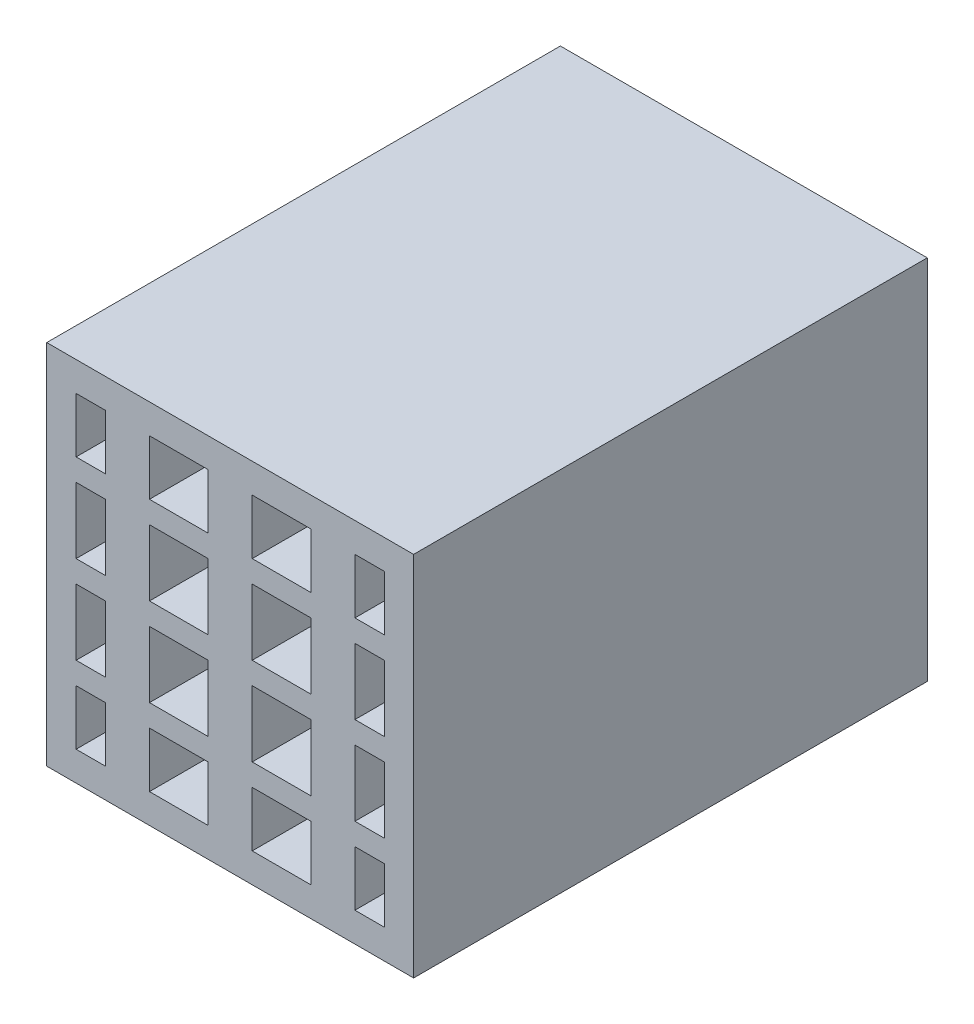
ISO-10303-21;
HEADER;
FILE_DESCRIPTION(('STEP AP214'),'2;1');
FILE_NAME('part.step','',(''),(''),'','','');
FILE_SCHEMA(('AUTOMOTIVE_DESIGN { 1 0 10303 214 1 1 1 1 }'));
ENDSEC;
DATA;
#1=APPLICATION_CONTEXT('core data for automotive mechanical design processes');
#2=APPLICATION_PROTOCOL_DEFINITION('international standard','automotive_design',2000,#1);
#3=PRODUCT_CONTEXT('',#1,'mechanical');
#4=PRODUCT('Part','Part','',(#3));
#5=PRODUCT_RELATED_PRODUCT_CATEGORY('part','',(#4));
#6=PRODUCT_DEFINITION_FORMATION('','',#4);
#7=PRODUCT_DEFINITION_CONTEXT('part definition',#1,'design');
#8=PRODUCT_DEFINITION('design','',#6,#7);
#9=PRODUCT_DEFINITION_SHAPE('','',#8);
#10=(LENGTH_UNIT() NAMED_UNIT(*) SI_UNIT(.MILLI.,.METRE.));
#11=(NAMED_UNIT(*) PLANE_ANGLE_UNIT() SI_UNIT($,.RADIAN.));
#12=(NAMED_UNIT(*) SI_UNIT($,.STERADIAN.) SOLID_ANGLE_UNIT());
#13=UNCERTAINTY_MEASURE_WITH_UNIT(LENGTH_MEASURE(1.E-05),#10,'distance_accuracy_value','');
#14=(GEOMETRIC_REPRESENTATION_CONTEXT(3) GLOBAL_UNCERTAINTY_ASSIGNED_CONTEXT((#13)) GLOBAL_UNIT_ASSIGNED_CONTEXT((#10,
#11,#12)) REPRESENTATION_CONTEXT('',''));
#15=CARTESIAN_POINT('',(0.,0.,0.));
#16=DIRECTION('',(0.,0.,1.));
#17=DIRECTION('',(1.,0.,0.));
#18=AXIS2_PLACEMENT_3D('',#15,#16,#17);
#19=CARTESIAN_POINT('',(-1.5,-10.5,25.));
#20=DIRECTION('',(-1.,0.,0.));
#21=DIRECTION('',(0.,0.,1.));
#22=AXIS2_PLACEMENT_3D('',#19,#20,#21);
#23=PLANE('',#22);
#24=DIRECTION('',(0.,0.,-1.));
#25=VECTOR('',#24,1.);
#26=CARTESIAN_POINT('',(-1.5,6.75,25.));
#27=LINE('',#26,#25);
#28=CARTESIAN_POINT('',(-1.5,6.75,25.));
#29=VERTEX_POINT('',#28);
#30=CARTESIAN_POINT('',(-1.5,6.75,0.));
#31=VERTEX_POINT('',#30);
#32=EDGE_CURVE('E609',#29,#31,#27,.T.);
#33=ORIENTED_EDGE('',*,*,#32,.F.);
#34=DIRECTION('',(0.,1.,0.));
#35=VECTOR('',#34,1.);
#36=CARTESIAN_POINT('',(-1.5,-10.5,25.));
#37=LINE('',#36,#35);
#38=CARTESIAN_POINT('',(-1.5,10.5,25.));
#39=VERTEX_POINT('',#38);
#40=EDGE_CURVE('E918',#29,#39,#37,.T.);
#41=ORIENTED_EDGE('',*,*,#40,.T.);
#42=DIRECTION('',(0.,0.,-1.));
#43=VECTOR('',#42,1.);
#44=CARTESIAN_POINT('',(-1.5,10.5,25.));
#45=LINE('',#44,#43);
#46=CARTESIAN_POINT('',(-1.5,10.5,0.));
#47=VERTEX_POINT('',#46);
#48=EDGE_CURVE('E953',#39,#47,#45,.T.);
#49=ORIENTED_EDGE('',*,*,#48,.T.);
#50=DIRECTION('',(0.,1.,0.));
#51=VECTOR('',#50,1.);
#52=CARTESIAN_POINT('',(-1.5,-10.5,0.));
#53=LINE('',#52,#51);
#54=EDGE_CURVE('E913',#31,#47,#53,.T.);
#55=ORIENTED_EDGE('',*,*,#54,.F.);
#56=EDGE_LOOP('',(#33,#41,#49,#55));
#57=FACE_BOUND('',#56,.T.);
#58=ADVANCED_FACE('F39',(#57),#23,.T.);
#59=CARTESIAN_POINT('',(-5.5,-10.5,25.));
#60=DIRECTION('',(1.,0.,0.));
#61=DIRECTION('',(0.,0.,-1.));
#62=AXIS2_PLACEMENT_3D('',#59,#60,#61);
#63=PLANE('',#62);
#64=DIRECTION('',(0.,0.,1.));
#65=VECTOR('',#64,1.);
#66=CARTESIAN_POINT('',(-5.5,6.75,25.));
#67=LINE('',#66,#65);
#68=CARTESIAN_POINT('',(-5.5,6.75,0.));
#69=VERTEX_POINT('',#68);
#70=CARTESIAN_POINT('',(-5.5,6.75,25.));
#71=VERTEX_POINT('',#70);
#72=EDGE_CURVE('E606',#69,#71,#67,.T.);
#73=ORIENTED_EDGE('',*,*,#72,.F.);
#74=DIRECTION('',(0.,-1.,0.));
#75=VECTOR('',#74,1.);
#76=CARTESIAN_POINT('',(-5.5,-10.5,0.));
#77=LINE('',#76,#75);
#78=CARTESIAN_POINT('',(-5.5,10.5,0.));
#79=VERTEX_POINT('',#78);
#80=EDGE_CURVE('E938',#79,#69,#77,.T.);
#81=ORIENTED_EDGE('',*,*,#80,.F.);
#82=DIRECTION('',(0.,0.,-1.));
#83=VECTOR('',#82,1.);
#84=CARTESIAN_POINT('',(-5.5,10.5,25.));
#85=LINE('',#84,#83);
#86=CARTESIAN_POINT('',(-5.5,10.5,25.));
#87=VERTEX_POINT('',#86);
#88=EDGE_CURVE('E951',#87,#79,#85,.T.);
#89=ORIENTED_EDGE('',*,*,#88,.F.);
#90=DIRECTION('',(0.,-1.,0.));
#91=VECTOR('',#90,1.);
#92=CARTESIAN_POINT('',(-5.5,-10.5,25.));
#93=LINE('',#92,#91);
#94=EDGE_CURVE('E922',#87,#71,#93,.T.);
#95=ORIENTED_EDGE('',*,*,#94,.T.);
#96=EDGE_LOOP('',(#73,#81,#89,#95));
#97=FACE_BOUND('',#96,.T.);
#98=ADVANCED_FACE('F1056',(#97),#63,.T.);
#99=CARTESIAN_POINT('',(-8.5,-10.5,25.));
#100=DIRECTION('',(-1.,0.,0.));
#101=DIRECTION('',(0.,0.,1.));
#102=AXIS2_PLACEMENT_3D('',#99,#100,#101);
#103=PLANE('',#102);
#104=DIRECTION('',(0.,0.,-1.));
#105=VECTOR('',#104,1.);
#106=CARTESIAN_POINT('',(-8.5,6.75,25.));
#107=LINE('',#106,#105);
#108=CARTESIAN_POINT('',(-8.5,6.74999999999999,25.));
#109=VERTEX_POINT('',#108);
#110=CARTESIAN_POINT('',(-8.5,6.74999999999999,0.));
#111=VERTEX_POINT('',#110);
#112=EDGE_CURVE('E603',#109,#111,#107,.T.);
#113=ORIENTED_EDGE('',*,*,#112,.F.);
#114=DIRECTION('',(0.,1.,0.));
#115=VECTOR('',#114,1.);
#116=CARTESIAN_POINT('',(-8.5,-10.5,25.));
#117=LINE('',#116,#115);
#118=CARTESIAN_POINT('',(-8.5,10.5,25.));
#119=VERTEX_POINT('',#118);
#120=EDGE_CURVE('E880',#109,#119,#117,.T.);
#121=ORIENTED_EDGE('',*,*,#120,.T.);
#122=DIRECTION('',(0.,0.,-1.));
#123=VECTOR('',#122,1.);
#124=CARTESIAN_POINT('',(-8.5,10.5,25.));
#125=LINE('',#124,#123);
#126=CARTESIAN_POINT('',(-8.5,10.5,0.));
#127=VERTEX_POINT('',#126);
#128=EDGE_CURVE('E910',#119,#127,#125,.T.);
#129=ORIENTED_EDGE('',*,*,#128,.T.);
#130=DIRECTION('',(0.,1.,0.));
#131=VECTOR('',#130,1.);
#132=CARTESIAN_POINT('',(-8.5,-10.5,0.));
#133=LINE('',#132,#131);
#134=EDGE_CURVE('E500',#111,#127,#133,.T.);
#135=ORIENTED_EDGE('',*,*,#134,.F.);
#136=EDGE_LOOP('',(#113,#121,#129,#135));
#137=FACE_BOUND('',#136,.T.);
#138=ADVANCED_FACE('F1058',(#137),#103,.T.);
#139=CARTESIAN_POINT('',(-10.5,-10.5,25.));
#140=DIRECTION('',(1.,0.,0.));
#141=DIRECTION('',(0.,0.,-1.));
#142=AXIS2_PLACEMENT_3D('',#139,#140,#141);
#143=PLANE('',#142);
#144=DIRECTION('',(0.,0.,1.));
#145=VECTOR('',#144,1.);
#146=CARTESIAN_POINT('',(-10.5,6.75,25.));
#147=LINE('',#146,#145);
#148=CARTESIAN_POINT('',(-10.5,6.75,0.));
#149=VERTEX_POINT('',#148);
#150=CARTESIAN_POINT('',(-10.5,6.75,25.));
#151=VERTEX_POINT('',#150);
#152=EDGE_CURVE('E600',#149,#151,#147,.T.);
#153=ORIENTED_EDGE('',*,*,#152,.F.);
#154=DIRECTION('',(0.,-1.,0.));
#155=VECTOR('',#154,1.);
#156=CARTESIAN_POINT('',(-10.5,-10.5,0.));
#157=LINE('',#156,#155);
#158=CARTESIAN_POINT('',(-10.5,10.5,0.));
#159=VERTEX_POINT('',#158);
#160=EDGE_CURVE('E895',#159,#149,#157,.T.);
#161=ORIENTED_EDGE('',*,*,#160,.F.);
#162=DIRECTION('',(0.,0.,-1.));
#163=VECTOR('',#162,1.);
#164=CARTESIAN_POINT('',(-10.5,10.5,25.));
#165=LINE('',#164,#163);
#166=CARTESIAN_POINT('',(-10.5,10.5,25.));
#167=VERTEX_POINT('',#166);
#168=EDGE_CURVE('E908',#167,#159,#165,.T.);
#169=ORIENTED_EDGE('',*,*,#168,.F.);
#170=DIRECTION('',(0.,-1.,0.));
#171=VECTOR('',#170,1.);
#172=CARTESIAN_POINT('',(-10.5,-10.5,25.));
#173=LINE('',#172,#171);
#174=EDGE_CURVE('E883',#167,#151,#173,.T.);
#175=ORIENTED_EDGE('',*,*,#174,.T.);
#176=EDGE_LOOP('',(#153,#161,#169,#175));
#177=FACE_BOUND('',#176,.T.);
#178=ADVANCED_FACE('F1066',(#177),#143,.T.);
#179=CARTESIAN_POINT('',(5.5,-10.5,25.));
#180=DIRECTION('',(-1.,0.,0.));
#181=DIRECTION('',(0.,-1.,0.));
#182=AXIS2_PLACEMENT_3D('',#179,#180,#181);
#183=PLANE('',#182);
#184=DIRECTION('',(0.,0.,-1.));
#185=VECTOR('',#184,1.);
#186=CARTESIAN_POINT('',(5.5,6.75,25.));
#187=LINE('',#186,#185);
#188=CARTESIAN_POINT('',(5.5,6.75,25.));
#189=VERTEX_POINT('',#188);
#190=CARTESIAN_POINT('',(5.5,6.75,0.));
#191=VERTEX_POINT('',#190);
#192=EDGE_CURVE('E597',#189,#191,#187,.T.);
#193=ORIENTED_EDGE('',*,*,#192,.F.);
#194=DIRECTION('',(0.,1.,0.));
#195=VECTOR('',#194,1.);
#196=CARTESIAN_POINT('',(5.5,-10.5,25.));
#197=LINE('',#196,#195);
#198=CARTESIAN_POINT('',(5.5,10.5,25.));
#199=VERTEX_POINT('',#198);
#200=EDGE_CURVE('E840',#189,#199,#197,.T.);
#201=ORIENTED_EDGE('',*,*,#200,.T.);
#202=DIRECTION('',(0.,0.,-1.));
#203=VECTOR('',#202,1.);
#204=CARTESIAN_POINT('',(5.5,10.5,25.));
#205=LINE('',#204,#203);
#206=CARTESIAN_POINT('',(5.5,10.5,0.));
#207=VERTEX_POINT('',#206);
#208=EDGE_CURVE('E873',#199,#207,#205,.T.);
#209=ORIENTED_EDGE('',*,*,#208,.T.);
#210=DIRECTION('',(0.,1.,0.));
#211=VECTOR('',#210,1.);
#212=CARTESIAN_POINT('',(5.5,-10.5,0.));
#213=LINE('',#212,#211);
#214=EDGE_CURVE('E835',#191,#207,#213,.T.);
#215=ORIENTED_EDGE('',*,*,#214,.F.);
#216=EDGE_LOOP('',(#193,#201,#209,#215));
#217=FACE_BOUND('',#216,.T.);
#218=ADVANCED_FACE('F1032',(#217),#183,.T.);
#219=CARTESIAN_POINT('',(1.5,-10.5,25.));
#220=DIRECTION('',(1.,0.,0.));
#221=DIRECTION('',(0.,1.,0.));
#222=AXIS2_PLACEMENT_3D('',#219,#220,#221);
#223=PLANE('',#222);
#224=DIRECTION('',(0.,0.,1.));
#225=VECTOR('',#224,1.);
#226=CARTESIAN_POINT('',(1.5,6.75,25.));
#227=LINE('',#226,#225);
#228=CARTESIAN_POINT('',(1.5,6.75,0.));
#229=VERTEX_POINT('',#228);
#230=CARTESIAN_POINT('',(1.5,6.75,25.));
#231=VERTEX_POINT('',#230);
#232=EDGE_CURVE('E594',#229,#231,#227,.T.);
#233=ORIENTED_EDGE('',*,*,#232,.F.);
#234=DIRECTION('',(0.,-1.,0.));
#235=VECTOR('',#234,1.);
#236=CARTESIAN_POINT('',(1.5,-10.5,0.));
#237=LINE('',#236,#235);
#238=CARTESIAN_POINT('',(1.5,10.5,0.));
#239=VERTEX_POINT('',#238);
#240=EDGE_CURVE('E858',#239,#229,#237,.T.);
#241=ORIENTED_EDGE('',*,*,#240,.F.);
#242=DIRECTION('',(0.,0.,-1.));
#243=VECTOR('',#242,1.);
#244=CARTESIAN_POINT('',(1.5,10.5,25.));
#245=LINE('',#244,#243);
#246=CARTESIAN_POINT('',(1.5,10.5,25.));
#247=VERTEX_POINT('',#246);
#248=EDGE_CURVE('E871',#247,#239,#245,.T.);
#249=ORIENTED_EDGE('',*,*,#248,.F.);
#250=DIRECTION('',(0.,-1.,0.));
#251=VECTOR('',#250,1.);
#252=CARTESIAN_POINT('',(1.5,-10.5,25.));
#253=LINE('',#252,#251);
#254=EDGE_CURVE('E843',#247,#231,#253,.T.);
#255=ORIENTED_EDGE('',*,*,#254,.T.);
#256=EDGE_LOOP('',(#233,#241,#249,#255));
#257=FACE_BOUND('',#256,.T.);
#258=ADVANCED_FACE('F1043',(#257),#223,.T.);
#259=CARTESIAN_POINT('',(10.5,-10.5,25.));
#260=DIRECTION('',(-1.,0.,0.));
#261=DIRECTION('',(0.,-1.,0.));
#262=AXIS2_PLACEMENT_3D('',#259,#260,#261);
#263=PLANE('',#262);
#264=DIRECTION('',(0.,0.,-1.));
#265=VECTOR('',#264,1.);
#266=CARTESIAN_POINT('',(10.5,6.75,25.));
#267=LINE('',#266,#265);
#268=CARTESIAN_POINT('',(10.5,6.75,25.));
#269=VERTEX_POINT('',#268);
#270=CARTESIAN_POINT('',(10.5,6.75,0.));
#271=VERTEX_POINT('',#270);
#272=EDGE_CURVE('E591',#269,#271,#267,.T.);
#273=ORIENTED_EDGE('',*,*,#272,.F.);
#274=DIRECTION('',(0.,1.,0.));
#275=VECTOR('',#274,1.);
#276=CARTESIAN_POINT('',(10.5,-10.5,25.));
#277=LINE('',#276,#275);
#278=CARTESIAN_POINT('',(10.5,10.5,25.));
#279=VERTEX_POINT('',#278);
#280=EDGE_CURVE('E798',#269,#279,#277,.T.);
#281=ORIENTED_EDGE('',*,*,#280,.T.);
#282=DIRECTION('',(0.,0.,-1.));
#283=VECTOR('',#282,1.);
#284=CARTESIAN_POINT('',(10.5,10.5,25.));
#285=LINE('',#284,#283);
#286=CARTESIAN_POINT('',(10.5,10.5,0.));
#287=VERTEX_POINT('',#286);
#288=EDGE_CURVE('E832',#279,#287,#285,.T.);
#289=ORIENTED_EDGE('',*,*,#288,.T.);
#290=DIRECTION('',(0.,1.,0.));
#291=VECTOR('',#290,1.);
#292=CARTESIAN_POINT('',(10.5,-10.5,0.));
#293=LINE('',#292,#291);
#294=EDGE_CURVE('E785',#271,#287,#293,.T.);
#295=ORIENTED_EDGE('',*,*,#294,.F.);
#296=EDGE_LOOP('',(#273,#281,#289,#295));
#297=FACE_BOUND('',#296,.T.);
#298=ADVANCED_FACE('F1154',(#297),#263,.T.);
#299=CARTESIAN_POINT('',(8.5,-10.5,25.));
#300=DIRECTION('',(1.,0.,0.));
#301=DIRECTION('',(0.,1.,0.));
#302=AXIS2_PLACEMENT_3D('',#299,#300,#301);
#303=PLANE('',#302);
#304=DIRECTION('',(0.,0.,1.));
#305=VECTOR('',#304,1.);
#306=CARTESIAN_POINT('',(8.5,6.75,25.));
#307=LINE('',#306,#305);
#308=CARTESIAN_POINT('',(8.5,6.74999999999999,0.));
#309=VERTEX_POINT('',#308);
#310=CARTESIAN_POINT('',(8.5,6.74999999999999,25.));
#311=VERTEX_POINT('',#310);
#312=EDGE_CURVE('E63',#309,#311,#307,.T.);
#313=ORIENTED_EDGE('',*,*,#312,.F.);
#314=DIRECTION('',(0.,-1.,0.));
#315=VECTOR('',#314,1.);
#316=CARTESIAN_POINT('',(8.5,-10.5,0.));
#317=LINE('',#316,#315);
#318=CARTESIAN_POINT('',(8.5,10.5,0.));
#319=VERTEX_POINT('',#318);
#320=EDGE_CURVE('E818',#319,#309,#317,.T.);
#321=ORIENTED_EDGE('',*,*,#320,.F.);
#322=DIRECTION('',(0.,0.,-1.));
#323=VECTOR('',#322,1.);
#324=CARTESIAN_POINT('',(8.5,10.5,25.));
#325=LINE('',#324,#323);
#326=CARTESIAN_POINT('',(8.5,10.5,25.));
#327=VERTEX_POINT('',#326);
#328=EDGE_CURVE('E830',#327,#319,#325,.T.);
#329=ORIENTED_EDGE('',*,*,#328,.F.);
#330=DIRECTION('',(0.,-1.,0.));
#331=VECTOR('',#330,1.);
#332=CARTESIAN_POINT('',(8.5,-10.5,25.));
#333=LINE('',#332,#331);
#334=EDGE_CURVE('E802',#327,#311,#333,.T.);
#335=ORIENTED_EDGE('',*,*,#334,.T.);
#336=EDGE_LOOP('',(#313,#321,#329,#335));
#337=FACE_BOUND('',#336,.T.);
#338=ADVANCED_FACE('F1287',(#337),#303,.T.);
#339=CARTESIAN_POINT('',(0.,0.,0.));
#340=DIRECTION('',(0.,0.,1.));
#341=DIRECTION('',(1.,0.,0.));
#342=AXIS2_PLACEMENT_3D('',#339,#340,#341);
#343=PLANE('',#342);
#344=DIRECTION('',(-1.,0.,0.));
#345=VECTOR('',#344,1.);
#346=CARTESIAN_POINT('',(12.5,6.75,0.));
#347=LINE('',#346,#345);
#348=EDGE_CURVE('E522',#271,#309,#347,.T.);
#349=ORIENTED_EDGE('',*,*,#348,.F.);
#350=ORIENTED_EDGE('',*,*,#294,.T.);
#351=DIRECTION('',(-1.,0.,0.));
#352=VECTOR('',#351,1.);
#353=CARTESIAN_POINT('',(10.5,10.5,0.));
#354=LINE('',#353,#352);
#355=EDGE_CURVE('E812',#287,#319,#354,.T.);
#356=ORIENTED_EDGE('',*,*,#355,.T.);
#357=ORIENTED_EDGE('',*,*,#320,.T.);
#358=EDGE_LOOP('',(#349,#350,#356,#357));
#359=FACE_BOUND('',#358,.T.);
#360=ADVANCED_FACE('F1147',(#359),#343,.T.);
#361=EDGE_CURVE('E1048',#191,#229,#347,.T.);
#362=ORIENTED_EDGE('',*,*,#361,.F.);
#363=ORIENTED_EDGE('',*,*,#214,.T.);
#364=DIRECTION('',(-1.,0.,0.));
#365=VECTOR('',#364,1.);
#366=CARTESIAN_POINT('',(5.5,10.5,0.));
#367=LINE('',#366,#365);
#368=EDGE_CURVE('E852',#207,#239,#367,.T.);
#369=ORIENTED_EDGE('',*,*,#368,.T.);
#370=ORIENTED_EDGE('',*,*,#240,.T.);
#371=EDGE_LOOP('',(#362,#363,#369,#370));
#372=FACE_BOUND('',#371,.T.);
#373=ADVANCED_FACE('F1724',(#372),#343,.T.);
#374=EDGE_CURVE('E516',#111,#149,#347,.T.);
#375=ORIENTED_EDGE('',*,*,#374,.F.);
#376=ORIENTED_EDGE('',*,*,#134,.T.);
#377=DIRECTION('',(-1.,0.,0.));
#378=VECTOR('',#377,1.);
#379=CARTESIAN_POINT('',(-10.5,10.5,0.));
#380=LINE('',#379,#378);
#381=EDGE_CURVE('E891',#127,#159,#380,.T.);
#382=ORIENTED_EDGE('',*,*,#381,.T.);
#383=ORIENTED_EDGE('',*,*,#160,.T.);
#384=EDGE_LOOP('',(#375,#376,#382,#383));
#385=FACE_BOUND('',#384,.T.);
#386=ADVANCED_FACE('F1234',(#385),#343,.T.);
#387=EDGE_CURVE('E520',#31,#69,#347,.T.);
#388=ORIENTED_EDGE('',*,*,#387,.F.);
#389=ORIENTED_EDGE('',*,*,#54,.T.);
#390=DIRECTION('',(-1.,0.,0.));
#391=VECTOR('',#390,1.);
#392=CARTESIAN_POINT('',(-5.5,10.5,0.));
#393=LINE('',#392,#391);
#394=EDGE_CURVE('E932',#47,#79,#393,.T.);
#395=ORIENTED_EDGE('',*,*,#394,.T.);
#396=ORIENTED_EDGE('',*,*,#80,.T.);
#397=EDGE_LOOP('',(#388,#389,#395,#396));
#398=FACE_BOUND('',#397,.T.);
#399=ADVANCED_FACE('F994',(#398),#343,.T.);
#400=DIRECTION('',(0.,0.,1.));
#401=VECTOR('',#400,1.);
#402=CARTESIAN_POINT('',(-1.5,-6.75,25.));
#403=LINE('',#402,#401);
#404=CARTESIAN_POINT('',(-1.5,-6.75,0.));
#405=VERTEX_POINT('',#404);
#406=CARTESIAN_POINT('',(-1.5,-6.75,25.));
#407=VERTEX_POINT('',#406);
#408=EDGE_CURVE('E677',#405,#407,#403,.T.);
#409=ORIENTED_EDGE('',*,*,#408,.F.);
#410=CARTESIAN_POINT('',(-1.5,-10.5,0.));
#411=VERTEX_POINT('',#410);
#412=EDGE_CURVE('E929',#411,#405,#53,.T.);
#413=ORIENTED_EDGE('',*,*,#412,.F.);
#414=DIRECTION('',(0.,0.,-1.));
#415=VECTOR('',#414,1.);
#416=CARTESIAN_POINT('',(-1.5,-10.5,25.));
#417=LINE('',#416,#415);
#418=CARTESIAN_POINT('',(-1.5,-10.5,25.));
#419=VERTEX_POINT('',#418);
#420=EDGE_CURVE('E928',#419,#411,#417,.T.);
#421=ORIENTED_EDGE('',*,*,#420,.F.);
#422=EDGE_CURVE('E914',#419,#407,#37,.T.);
#423=ORIENTED_EDGE('',*,*,#422,.T.);
#424=EDGE_LOOP('',(#409,#413,#421,#423));
#425=FACE_BOUND('',#424,.T.);
#426=ADVANCED_FACE('F1072',(#425),#23,.T.);
#427=DIRECTION('',(0.,0.,-1.));
#428=VECTOR('',#427,1.);
#429=CARTESIAN_POINT('',(-5.5,-6.75,25.));
#430=LINE('',#429,#428);
#431=CARTESIAN_POINT('',(-5.5,-6.75,25.));
#432=VERTEX_POINT('',#431);
#433=CARTESIAN_POINT('',(-5.5,-6.75,0.));
#434=VERTEX_POINT('',#433);
#435=EDGE_CURVE('E674',#432,#434,#430,.T.);
#436=ORIENTED_EDGE('',*,*,#435,.F.);
#437=CARTESIAN_POINT('',(-5.5,-10.5,25.));
#438=VERTEX_POINT('',#437);
#439=EDGE_CURVE('E921',#432,#438,#93,.T.);
#440=ORIENTED_EDGE('',*,*,#439,.T.);
#441=DIRECTION('',(0.,0.,-1.));
#442=VECTOR('',#441,1.);
#443=CARTESIAN_POINT('',(-5.5,-10.5,25.));
#444=LINE('',#443,#442);
#445=CARTESIAN_POINT('',(-5.5,-10.5,0.));
#446=VERTEX_POINT('',#445);
#447=EDGE_CURVE('E948',#438,#446,#444,.T.);
#448=ORIENTED_EDGE('',*,*,#447,.T.);
#449=EDGE_CURVE('E937',#434,#446,#77,.T.);
#450=ORIENTED_EDGE('',*,*,#449,.F.);
#451=EDGE_LOOP('',(#436,#440,#448,#450));
#452=FACE_BOUND('',#451,.T.);
#453=ADVANCED_FACE('F1060',(#452),#63,.T.);
#454=DIRECTION('',(0.,0.,1.));
#455=VECTOR('',#454,1.);
#456=CARTESIAN_POINT('',(-8.5,-6.75,25.));
#457=LINE('',#456,#455);
#458=CARTESIAN_POINT('',(-8.5,-6.75,0.));
#459=VERTEX_POINT('',#458);
#460=CARTESIAN_POINT('',(-8.5,-6.75,25.));
#461=VERTEX_POINT('',#460);
#462=EDGE_CURVE('E671',#459,#461,#457,.T.);
#463=ORIENTED_EDGE('',*,*,#462,.F.);
#464=CARTESIAN_POINT('',(-8.5,-10.5,0.));
#465=VERTEX_POINT('',#464);
#466=EDGE_CURVE('E502',#465,#459,#133,.T.);
#467=ORIENTED_EDGE('',*,*,#466,.F.);
#468=DIRECTION('',(0.,0.,-1.));
#469=VECTOR('',#468,1.);
#470=CARTESIAN_POINT('',(-8.5,-10.5,25.));
#471=LINE('',#470,#469);
#472=CARTESIAN_POINT('',(-8.5,-10.5,25.));
#473=VERTEX_POINT('',#472);
#474=EDGE_CURVE('E888',#473,#465,#471,.T.);
#475=ORIENTED_EDGE('',*,*,#474,.F.);
#476=EDGE_CURVE('E876',#473,#461,#117,.T.);
#477=ORIENTED_EDGE('',*,*,#476,.T.);
#478=EDGE_LOOP('',(#463,#467,#475,#477));
#479=FACE_BOUND('',#478,.T.);
#480=ADVANCED_FACE('F1069',(#479),#103,.T.);
#481=DIRECTION('',(0.,0.,-1.));
#482=VECTOR('',#481,1.);
#483=CARTESIAN_POINT('',(-10.5,-6.75,25.));
#484=LINE('',#483,#482);
#485=CARTESIAN_POINT('',(-10.5,-6.75,25.));
#486=VERTEX_POINT('',#485);
#487=CARTESIAN_POINT('',(-10.5,-6.75,0.));
#488=VERTEX_POINT('',#487);
#489=EDGE_CURVE('E668',#486,#488,#484,.T.);
#490=ORIENTED_EDGE('',*,*,#489,.F.);
#491=CARTESIAN_POINT('',(-10.5,-10.5,25.));
#492=VERTEX_POINT('',#491);
#493=EDGE_CURVE('E882',#486,#492,#173,.T.);
#494=ORIENTED_EDGE('',*,*,#493,.T.);
#495=DIRECTION('',(0.,0.,-1.));
#496=VECTOR('',#495,1.);
#497=CARTESIAN_POINT('',(-10.5,-10.5,25.));
#498=LINE('',#497,#496);
#499=CARTESIAN_POINT('',(-10.5,-10.5,0.));
#500=VERTEX_POINT('',#499);
#501=EDGE_CURVE('E905',#492,#500,#498,.T.);
#502=ORIENTED_EDGE('',*,*,#501,.T.);
#503=EDGE_CURVE('E894',#488,#500,#157,.T.);
#504=ORIENTED_EDGE('',*,*,#503,.F.);
#505=EDGE_LOOP('',(#490,#494,#502,#504));
#506=FACE_BOUND('',#505,.T.);
#507=ADVANCED_FACE('F1214',(#506),#143,.T.);
#508=DIRECTION('',(0.,0.,1.));
#509=VECTOR('',#508,1.);
#510=CARTESIAN_POINT('',(5.5,-6.75,25.));
#511=LINE('',#510,#509);
#512=CARTESIAN_POINT('',(5.5,-6.75,0.));
#513=VERTEX_POINT('',#512);
#514=CARTESIAN_POINT('',(5.5,-6.75,25.));
#515=VERTEX_POINT('',#514);
#516=EDGE_CURVE('E665',#513,#515,#511,.T.);
#517=ORIENTED_EDGE('',*,*,#516,.F.);
#518=CARTESIAN_POINT('',(5.5,-10.5,0.));
#519=VERTEX_POINT('',#518);
#520=EDGE_CURVE('E849',#519,#513,#213,.T.);
#521=ORIENTED_EDGE('',*,*,#520,.F.);
#522=DIRECTION('',(0.,0.,-1.));
#523=VECTOR('',#522,1.);
#524=CARTESIAN_POINT('',(5.5,-10.5,25.));
#525=LINE('',#524,#523);
#526=CARTESIAN_POINT('',(5.5,-10.5,25.));
#527=VERTEX_POINT('',#526);
#528=EDGE_CURVE('E848',#527,#519,#525,.T.);
#529=ORIENTED_EDGE('',*,*,#528,.F.);
#530=EDGE_CURVE('E836',#527,#515,#197,.T.);
#531=ORIENTED_EDGE('',*,*,#530,.T.);
#532=EDGE_LOOP('',(#517,#521,#529,#531));
#533=FACE_BOUND('',#532,.T.);
#534=ADVANCED_FACE('F1199',(#533),#183,.T.);
#535=DIRECTION('',(0.,0.,-1.));
#536=VECTOR('',#535,1.);
#537=CARTESIAN_POINT('',(1.5,-6.75,25.));
#538=LINE('',#537,#536);
#539=CARTESIAN_POINT('',(1.5,-6.75,25.));
#540=VERTEX_POINT('',#539);
#541=CARTESIAN_POINT('',(1.5,-6.75,0.));
#542=VERTEX_POINT('',#541);
#543=EDGE_CURVE('E662',#540,#542,#538,.T.);
#544=ORIENTED_EDGE('',*,*,#543,.F.);
#545=CARTESIAN_POINT('',(1.5,-10.5,25.));
#546=VERTEX_POINT('',#545);
#547=EDGE_CURVE('E842',#540,#546,#253,.T.);
#548=ORIENTED_EDGE('',*,*,#547,.T.);
#549=DIRECTION('',(0.,0.,-1.));
#550=VECTOR('',#549,1.);
#551=CARTESIAN_POINT('',(1.5,-10.5,25.));
#552=LINE('',#551,#550);
#553=CARTESIAN_POINT('',(1.5,-10.5,0.));
#554=VERTEX_POINT('',#553);
#555=EDGE_CURVE('E868',#546,#554,#552,.T.);
#556=ORIENTED_EDGE('',*,*,#555,.T.);
#557=EDGE_CURVE('E857',#542,#554,#237,.T.);
#558=ORIENTED_EDGE('',*,*,#557,.F.);
#559=EDGE_LOOP('',(#544,#548,#556,#558));
#560=FACE_BOUND('',#559,.T.);
#561=ADVANCED_FACE('F1187',(#560),#223,.T.);
#562=DIRECTION('',(0.,0.,1.));
#563=VECTOR('',#562,1.);
#564=CARTESIAN_POINT('',(10.5,-6.75,25.));
#565=LINE('',#564,#563);
#566=CARTESIAN_POINT('',(10.5,-6.75,0.));
#567=VERTEX_POINT('',#566);
#568=CARTESIAN_POINT('',(10.5,-6.75,25.));
#569=VERTEX_POINT('',#568);
#570=EDGE_CURVE('E659',#567,#569,#565,.T.);
#571=ORIENTED_EDGE('',*,*,#570,.F.);
#572=CARTESIAN_POINT('',(10.5,-10.5,0.));
#573=VERTEX_POINT('',#572);
#574=EDGE_CURVE('E809',#573,#567,#293,.T.);
#575=ORIENTED_EDGE('',*,*,#574,.F.);
#576=DIRECTION('',(0.,0.,-1.));
#577=VECTOR('',#576,1.);
#578=CARTESIAN_POINT('',(10.5,-10.5,25.));
#579=LINE('',#578,#577);
#580=CARTESIAN_POINT('',(10.5,-10.5,25.));
#581=VERTEX_POINT('',#580);
#582=EDGE_CURVE('E808',#581,#573,#579,.T.);
#583=ORIENTED_EDGE('',*,*,#582,.F.);
#584=EDGE_CURVE('E794',#581,#569,#277,.T.);
#585=ORIENTED_EDGE('',*,*,#584,.T.);
#586=EDGE_LOOP('',(#571,#575,#583,#585));
#587=FACE_BOUND('',#586,.T.);
#588=ADVANCED_FACE('F1134',(#587),#263,.T.);
#589=DIRECTION('',(0.,0.,-1.));
#590=VECTOR('',#589,1.);
#591=CARTESIAN_POINT('',(8.5,-6.75,25.));
#592=LINE('',#591,#590);
#593=CARTESIAN_POINT('',(8.5,-6.75,25.));
#594=VERTEX_POINT('',#593);
#595=CARTESIAN_POINT('',(8.5,-6.75,0.));
#596=VERTEX_POINT('',#595);
#597=EDGE_CURVE('E656',#594,#596,#592,.T.);
#598=ORIENTED_EDGE('',*,*,#597,.F.);
#599=CARTESIAN_POINT('',(8.5,-10.5,25.));
#600=VERTEX_POINT('',#599);
#601=EDGE_CURVE('E801',#594,#600,#333,.T.);
#602=ORIENTED_EDGE('',*,*,#601,.T.);
#603=DIRECTION('',(0.,0.,-1.));
#604=VECTOR('',#603,1.);
#605=CARTESIAN_POINT('',(8.5,-10.5,25.));
#606=LINE('',#605,#604);
#607=CARTESIAN_POINT('',(8.5,-10.5,0.));
#608=VERTEX_POINT('',#607);
#609=EDGE_CURVE('E827',#600,#608,#606,.T.);
#610=ORIENTED_EDGE('',*,*,#609,.T.);
#611=EDGE_CURVE('E817',#596,#608,#317,.T.);
#612=ORIENTED_EDGE('',*,*,#611,.F.);
#613=EDGE_LOOP('',(#598,#602,#610,#612));
#614=FACE_BOUND('',#613,.T.);
#615=ADVANCED_FACE('F1123',(#614),#303,.T.);
#616=DIRECTION('',(1.,0.,0.));
#617=VECTOR('',#616,1.);
#618=CARTESIAN_POINT('',(12.5,-6.75,0.));
#619=LINE('',#618,#617);
#620=EDGE_CURVE('E619',#596,#567,#619,.T.);
#621=ORIENTED_EDGE('',*,*,#620,.F.);
#622=ORIENTED_EDGE('',*,*,#611,.T.);
#623=DIRECTION('',(1.,0.,0.));
#624=VECTOR('',#623,1.);
#625=CARTESIAN_POINT('',(10.5,-10.5,0.));
#626=LINE('',#625,#624);
#627=EDGE_CURVE('E820',#608,#573,#626,.T.);
#628=ORIENTED_EDGE('',*,*,#627,.T.);
#629=ORIENTED_EDGE('',*,*,#574,.T.);
#630=EDGE_LOOP('',(#621,#622,#628,#629));
#631=FACE_BOUND('',#630,.T.);
#632=ADVANCED_FACE('F1138',(#631),#343,.T.);
#633=EDGE_CURVE('E622',#542,#513,#619,.T.);
#634=ORIENTED_EDGE('',*,*,#633,.F.);
#635=ORIENTED_EDGE('',*,*,#557,.T.);
#636=DIRECTION('',(1.,0.,0.));
#637=VECTOR('',#636,1.);
#638=CARTESIAN_POINT('',(5.5,-10.5,0.));
#639=LINE('',#638,#637);
#640=EDGE_CURVE('E861',#554,#519,#639,.T.);
#641=ORIENTED_EDGE('',*,*,#640,.T.);
#642=ORIENTED_EDGE('',*,*,#520,.T.);
#643=EDGE_LOOP('',(#634,#635,#641,#642));
#644=FACE_BOUND('',#643,.T.);
#645=ADVANCED_FACE('F1643',(#644),#343,.T.);
#646=EDGE_CURVE('E623',#488,#459,#619,.T.);
#647=ORIENTED_EDGE('',*,*,#646,.F.);
#648=ORIENTED_EDGE('',*,*,#503,.T.);
#649=DIRECTION('',(1.,0.,0.));
#650=VECTOR('',#649,1.);
#651=CARTESIAN_POINT('',(-10.5,-10.5,0.));
#652=LINE('',#651,#650);
#653=EDGE_CURVE('E898',#500,#465,#652,.T.);
#654=ORIENTED_EDGE('',*,*,#653,.T.);
#655=ORIENTED_EDGE('',*,*,#466,.T.);
#656=EDGE_LOOP('',(#647,#648,#654,#655));
#657=FACE_BOUND('',#656,.T.);
#658=ADVANCED_FACE('F1211',(#657),#343,.T.);
#659=DIRECTION('',(1.,0.,0.));
#660=VECTOR('',#659,1.);
#661=CARTESIAN_POINT('',(0.,-6.75,0.));
#662=LINE('',#661,#660);
#663=EDGE_CURVE('E11',#434,#405,#662,.T.);
#664=ORIENTED_EDGE('',*,*,#663,.F.);
#665=ORIENTED_EDGE('',*,*,#449,.T.);
#666=DIRECTION('',(1.,0.,0.));
#667=VECTOR('',#666,1.);
#668=CARTESIAN_POINT('',(-5.5,-10.5,0.));
#669=LINE('',#668,#667);
#670=EDGE_CURVE('E941',#446,#411,#669,.T.);
#671=ORIENTED_EDGE('',*,*,#670,.T.);
#672=ORIENTED_EDGE('',*,*,#412,.T.);
#673=EDGE_LOOP('',(#664,#665,#671,#672));
#674=FACE_BOUND('',#673,.T.);
#675=ADVANCED_FACE('F1094',(#674),#343,.T.);
#676=DIRECTION('',(0.,0.,1.));
#677=VECTOR('',#676,1.);
#678=CARTESIAN_POINT('',(-1.5,5.25,25.));
#679=LINE('',#678,#677);
#680=CARTESIAN_POINT('',(-1.5,5.25,0.));
#681=VERTEX_POINT('',#680);
#682=CARTESIAN_POINT('',(-1.5,5.25,25.));
#683=VERTEX_POINT('',#682);
#684=EDGE_CURVE('E587',#681,#683,#679,.T.);
#685=ORIENTED_EDGE('',*,*,#684,.F.);
#686=CARTESIAN_POINT('',(-1.5,0.750000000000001,0.));
#687=VERTEX_POINT('',#686);
#688=EDGE_CURVE('E934',#687,#681,#53,.T.);
#689=ORIENTED_EDGE('',*,*,#688,.F.);
#690=DIRECTION('',(0.,0.,-1.));
#691=VECTOR('',#690,1.);
#692=CARTESIAN_POINT('',(-1.5,0.750000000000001,25.));
#693=LINE('',#692,#691);
#694=CARTESIAN_POINT('',(-1.5,0.750000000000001,25.));
#695=VERTEX_POINT('',#694);
#696=EDGE_CURVE('E742',#695,#687,#693,.T.);
#697=ORIENTED_EDGE('',*,*,#696,.F.);
#698=EDGE_CURVE('E919',#695,#683,#37,.T.);
#699=ORIENTED_EDGE('',*,*,#698,.T.);
#700=EDGE_LOOP('',(#685,#689,#697,#699));
#701=FACE_BOUND('',#700,.T.);
#702=ADVANCED_FACE('F1087',(#701),#23,.T.);
#703=DIRECTION('',(0.,0.,-1.));
#704=VECTOR('',#703,1.);
#705=CARTESIAN_POINT('',(-5.5,5.25,25.));
#706=LINE('',#705,#704);
#707=CARTESIAN_POINT('',(-5.5,5.25,25.));
#708=VERTEX_POINT('',#707);
#709=CARTESIAN_POINT('',(-5.5,5.25,0.));
#710=VERTEX_POINT('',#709);
#711=EDGE_CURVE('E511',#708,#710,#706,.T.);
#712=ORIENTED_EDGE('',*,*,#711,.F.);
#713=CARTESIAN_POINT('',(-5.5,0.750000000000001,25.));
#714=VERTEX_POINT('',#713);
#715=EDGE_CURVE('E925',#708,#714,#93,.T.);
#716=ORIENTED_EDGE('',*,*,#715,.T.);
#717=DIRECTION('',(0.,0.,1.));
#718=VECTOR('',#717,1.);
#719=CARTESIAN_POINT('',(-5.5,0.750000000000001,25.));
#720=LINE('',#719,#718);
#721=CARTESIAN_POINT('',(-5.5,0.750000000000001,0.));
#722=VERTEX_POINT('',#721);
#723=EDGE_CURVE('E739',#722,#714,#720,.T.);
#724=ORIENTED_EDGE('',*,*,#723,.F.);
#725=EDGE_CURVE('E942',#710,#722,#77,.T.);
#726=ORIENTED_EDGE('',*,*,#725,.F.);
#727=EDGE_LOOP('',(#712,#716,#724,#726));
#728=FACE_BOUND('',#727,.T.);
#729=ADVANCED_FACE('F1077',(#728),#63,.T.);
#730=DIRECTION('',(0.,0.,1.));
#731=VECTOR('',#730,1.);
#732=CARTESIAN_POINT('',(-8.5,5.25,25.));
#733=LINE('',#732,#731);
#734=CARTESIAN_POINT('',(-8.49999999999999,5.25,0.));
#735=VERTEX_POINT('',#734);
#736=CARTESIAN_POINT('',(-8.5,5.24999999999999,25.));
#737=VERTEX_POINT('',#736);
#738=EDGE_CURVE('E504',#735,#737,#733,.T.);
#739=ORIENTED_EDGE('',*,*,#738,.F.);
#740=CARTESIAN_POINT('',(-8.5,0.749999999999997,0.));
#741=VERTEX_POINT('',#740);
#742=EDGE_CURVE('E489',#741,#735,#133,.T.);
#743=ORIENTED_EDGE('',*,*,#742,.F.);
#744=DIRECTION('',(0.,0.,-1.));
#745=VECTOR('',#744,1.);
#746=CARTESIAN_POINT('',(-8.5,0.750000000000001,25.));
#747=LINE('',#746,#745);
#748=CARTESIAN_POINT('',(-8.5,0.749999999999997,25.));
#749=VERTEX_POINT('',#748);
#750=EDGE_CURVE('E737',#749,#741,#747,.T.);
#751=ORIENTED_EDGE('',*,*,#750,.F.);
#752=EDGE_CURVE('E507',#749,#737,#117,.T.);
#753=ORIENTED_EDGE('',*,*,#752,.T.);
#754=EDGE_LOOP('',(#739,#743,#751,#753));
#755=FACE_BOUND('',#754,.T.);
#756=ADVANCED_FACE('F505',(#755),#103,.T.);
#757=DIRECTION('',(0.,0.,-1.));
#758=VECTOR('',#757,1.);
#759=CARTESIAN_POINT('',(-10.5,5.25,25.));
#760=LINE('',#759,#758);
#761=CARTESIAN_POINT('',(-10.5,5.25,25.));
#762=VERTEX_POINT('',#761);
#763=CARTESIAN_POINT('',(-10.5,5.25,0.));
#764=VERTEX_POINT('',#763);
#765=EDGE_CURVE('E512',#762,#764,#760,.T.);
#766=ORIENTED_EDGE('',*,*,#765,.F.);
#767=CARTESIAN_POINT('',(-10.5,0.750000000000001,25.));
#768=VERTEX_POINT('',#767);
#769=EDGE_CURVE('E886',#762,#768,#173,.T.);
#770=ORIENTED_EDGE('',*,*,#769,.T.);
#771=DIRECTION('',(0.,0.,1.));
#772=VECTOR('',#771,1.);
#773=CARTESIAN_POINT('',(-10.5,0.750000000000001,25.));
#774=LINE('',#773,#772);
#775=CARTESIAN_POINT('',(-10.5,0.750000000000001,0.));
#776=VERTEX_POINT('',#775);
#777=EDGE_CURVE('E734',#776,#768,#774,.T.);
#778=ORIENTED_EDGE('',*,*,#777,.F.);
#779=EDGE_CURVE('E899',#764,#776,#157,.T.);
#780=ORIENTED_EDGE('',*,*,#779,.F.);
#781=EDGE_LOOP('',(#766,#770,#778,#780));
#782=FACE_BOUND('',#781,.T.);
#783=ADVANCED_FACE('F1093',(#782),#143,.T.);
#784=DIRECTION('',(0.,0.,1.));
#785=VECTOR('',#784,1.);
#786=CARTESIAN_POINT('',(5.5,5.25,25.));
#787=LINE('',#786,#785);
#788=CARTESIAN_POINT('',(5.5,5.25,0.));
#789=VERTEX_POINT('',#788);
#790=CARTESIAN_POINT('',(5.5,5.25,25.));
#791=VERTEX_POINT('',#790);
#792=EDGE_CURVE('E576',#789,#791,#787,.T.);
#793=ORIENTED_EDGE('',*,*,#792,.F.);
#794=CARTESIAN_POINT('',(5.5,0.750000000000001,0.));
#795=VERTEX_POINT('',#794);
#796=EDGE_CURVE('E854',#795,#789,#213,.T.);
#797=ORIENTED_EDGE('',*,*,#796,.F.);
#798=DIRECTION('',(0.,0.,-1.));
#799=VECTOR('',#798,1.);
#800=CARTESIAN_POINT('',(5.5,0.750000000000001,25.));
#801=LINE('',#800,#799);
#802=CARTESIAN_POINT('',(5.5,0.750000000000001,25.));
#803=VERTEX_POINT('',#802);
#804=EDGE_CURVE('E731',#803,#795,#801,.T.);
#805=ORIENTED_EDGE('',*,*,#804,.F.);
#806=EDGE_CURVE('E567',#803,#791,#197,.T.);
#807=ORIENTED_EDGE('',*,*,#806,.T.);
#808=EDGE_LOOP('',(#793,#797,#805,#807));
#809=FACE_BOUND('',#808,.T.);
#810=ADVANCED_FACE('F1273',(#809),#183,.T.);
#811=DIRECTION('',(0.,0.,-1.));
#812=VECTOR('',#811,1.);
#813=CARTESIAN_POINT('',(1.5,5.25,25.));
#814=LINE('',#813,#812);
#815=CARTESIAN_POINT('',(1.5,5.25,25.));
#816=VERTEX_POINT('',#815);
#817=CARTESIAN_POINT('',(1.5,5.25,0.));
#818=VERTEX_POINT('',#817);
#819=EDGE_CURVE('E574',#816,#818,#814,.T.);
#820=ORIENTED_EDGE('',*,*,#819,.F.);
#821=CARTESIAN_POINT('',(1.5,0.750000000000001,25.));
#822=VERTEX_POINT('',#821);
#823=EDGE_CURVE('E569',#816,#822,#253,.T.);
#824=ORIENTED_EDGE('',*,*,#823,.T.);
#825=DIRECTION('',(0.,0.,1.));
#826=VECTOR('',#825,1.);
#827=CARTESIAN_POINT('',(1.5,0.750000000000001,25.));
#828=LINE('',#827,#826);
#829=CARTESIAN_POINT('',(1.5,0.750000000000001,0.));
#830=VERTEX_POINT('',#829);
#831=EDGE_CURVE('E728',#830,#822,#828,.T.);
#832=ORIENTED_EDGE('',*,*,#831,.F.);
#833=EDGE_CURVE('E862',#818,#830,#237,.T.);
#834=ORIENTED_EDGE('',*,*,#833,.F.);
#835=EDGE_LOOP('',(#820,#824,#832,#834));
#836=FACE_BOUND('',#835,.T.);
#837=ADVANCED_FACE('F1278',(#836),#223,.T.);
#838=DIRECTION('',(0.,0.,1.));
#839=VECTOR('',#838,1.);
#840=CARTESIAN_POINT('',(10.5,5.25,25.));
#841=LINE('',#840,#839);
#842=CARTESIAN_POINT('',(10.5,5.25,0.));
#843=VERTEX_POINT('',#842);
#844=CARTESIAN_POINT('',(10.5,5.25,25.));
#845=VERTEX_POINT('',#844);
#846=EDGE_CURVE('E581',#843,#845,#841,.T.);
#847=ORIENTED_EDGE('',*,*,#846,.F.);
#848=CARTESIAN_POINT('',(10.5,0.750000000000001,0.));
#849=VERTEX_POINT('',#848);
#850=EDGE_CURVE('E814',#849,#843,#293,.T.);
#851=ORIENTED_EDGE('',*,*,#850,.F.);
#852=DIRECTION('',(0.,0.,-1.));
#853=VECTOR('',#852,1.);
#854=CARTESIAN_POINT('',(10.5,0.750000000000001,25.));
#855=LINE('',#854,#853);
#856=CARTESIAN_POINT('',(10.5,0.750000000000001,25.));
#857=VERTEX_POINT('',#856);
#858=EDGE_CURVE('E725',#857,#849,#855,.T.);
#859=ORIENTED_EDGE('',*,*,#858,.F.);
#860=EDGE_CURVE('E799',#857,#845,#277,.T.);
#861=ORIENTED_EDGE('',*,*,#860,.T.);
#862=EDGE_LOOP('',(#847,#851,#859,#861));
#863=FACE_BOUND('',#862,.T.);
#864=ADVANCED_FACE('F1143',(#863),#263,.T.);
#865=DIRECTION('',(0.,0.,-1.));
#866=VECTOR('',#865,1.);
#867=CARTESIAN_POINT('',(8.5,5.25,25.));
#868=LINE('',#867,#866);
#869=CARTESIAN_POINT('',(8.5,5.24999999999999,25.));
#870=VERTEX_POINT('',#869);
#871=CARTESIAN_POINT('',(8.5,5.24999999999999,0.));
#872=VERTEX_POINT('',#871);
#873=EDGE_CURVE('E1051',#870,#872,#868,.T.);
#874=ORIENTED_EDGE('',*,*,#873,.F.);
#875=CARTESIAN_POINT('',(8.5,0.749999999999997,25.));
#876=VERTEX_POINT('',#875);
#877=EDGE_CURVE('E805',#870,#876,#333,.T.);
#878=ORIENTED_EDGE('',*,*,#877,.T.);
#879=DIRECTION('',(0.,0.,1.));
#880=VECTOR('',#879,1.);
#881=CARTESIAN_POINT('',(8.5,0.750000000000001,25.));
#882=LINE('',#881,#880);
#883=CARTESIAN_POINT('',(8.5,0.749999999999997,0.));
#884=VERTEX_POINT('',#883);
#885=EDGE_CURVE('E722',#884,#876,#882,.T.);
#886=ORIENTED_EDGE('',*,*,#885,.F.);
#887=EDGE_CURVE('E821',#872,#884,#317,.T.);
#888=ORIENTED_EDGE('',*,*,#887,.F.);
#889=EDGE_LOOP('',(#874,#878,#886,#888));
#890=FACE_BOUND('',#889,.T.);
#891=ADVANCED_FACE('F1119',(#890),#303,.T.);
#892=DIRECTION('',(1.,0.,0.));
#893=VECTOR('',#892,1.);
#894=CARTESIAN_POINT('',(12.5,5.25,0.));
#895=LINE('',#894,#893);
#896=EDGE_CURVE('E55',#872,#843,#895,.T.);
#897=ORIENTED_EDGE('',*,*,#896,.F.);
#898=ORIENTED_EDGE('',*,*,#887,.T.);
#899=DIRECTION('',(-1.,0.,0.));
#900=VECTOR('',#899,1.);
#901=CARTESIAN_POINT('',(12.5,0.75,0.));
#902=LINE('',#901,#900);
#903=EDGE_CURVE('E689',#849,#884,#902,.T.);
#904=ORIENTED_EDGE('',*,*,#903,.F.);
#905=ORIENTED_EDGE('',*,*,#850,.T.);
#906=EDGE_LOOP('',(#897,#898,#904,#905));
#907=FACE_BOUND('',#906,.T.);
#908=ADVANCED_FACE('F1139',(#907),#343,.T.);
#909=EDGE_CURVE('E524',#818,#789,#895,.T.);
#910=ORIENTED_EDGE('',*,*,#909,.F.);
#911=ORIENTED_EDGE('',*,*,#833,.T.);
#912=EDGE_CURVE('E688',#795,#830,#902,.T.);
#913=ORIENTED_EDGE('',*,*,#912,.F.);
#914=ORIENTED_EDGE('',*,*,#796,.T.);
#915=EDGE_LOOP('',(#910,#911,#913,#914));
#916=FACE_BOUND('',#915,.T.);
#917=ADVANCED_FACE('F1575',(#916),#343,.T.);
#918=EDGE_CURVE('E493',#764,#735,#895,.T.);
#919=ORIENTED_EDGE('',*,*,#918,.F.);
#920=ORIENTED_EDGE('',*,*,#779,.T.);
#921=EDGE_CURVE('E496',#741,#776,#902,.T.);
#922=ORIENTED_EDGE('',*,*,#921,.F.);
#923=ORIENTED_EDGE('',*,*,#742,.T.);
#924=EDGE_LOOP('',(#919,#920,#922,#923));
#925=FACE_BOUND('',#924,.T.);
#926=ADVANCED_FACE('F491',(#925),#343,.T.);
#927=EDGE_CURVE('E517',#710,#681,#895,.T.);
#928=ORIENTED_EDGE('',*,*,#927,.F.);
#929=ORIENTED_EDGE('',*,*,#725,.T.);
#930=DIRECTION('',(-1.,0.,0.));
#931=VECTOR('',#930,1.);
#932=CARTESIAN_POINT('',(0.,0.75,0.));
#933=LINE('',#932,#931);
#934=EDGE_CURVE('E975',#687,#722,#933,.T.);
#935=ORIENTED_EDGE('',*,*,#934,.F.);
#936=ORIENTED_EDGE('',*,*,#688,.T.);
#937=EDGE_LOOP('',(#928,#929,#935,#936));
#938=FACE_BOUND('',#937,.T.);
#939=ADVANCED_FACE('F1448',(#938),#343,.T.);
#940=CARTESIAN_POINT('',(0.,0.,25.));
#941=DIRECTION('',(0.,0.,-1.));
#942=DIRECTION('',(-1.,0.,0.));
#943=AXIS2_PLACEMENT_3D('',#940,#941,#942);
#944=PLANE('',#943);
#945=ORIENTED_EDGE('',*,*,#40,.F.);
#946=DIRECTION('',(-1.,0.,0.));
#947=VECTOR('',#946,1.);
#948=CARTESIAN_POINT('',(12.5,6.75,25.));
#949=LINE('',#948,#947);
#950=EDGE_CURVE('E539',#29,#71,#949,.T.);
#951=ORIENTED_EDGE('',*,*,#950,.T.);
#952=ORIENTED_EDGE('',*,*,#94,.F.);
#953=DIRECTION('',(-1.,0.,0.));
#954=VECTOR('',#953,1.);
#955=CARTESIAN_POINT('',(-5.5,10.5,25.));
#956=LINE('',#955,#954);
#957=EDGE_CURVE('E916',#39,#87,#956,.T.);
#958=ORIENTED_EDGE('',*,*,#957,.F.);
#959=EDGE_LOOP('',(#945,#951,#952,#958));
#960=FACE_BOUND('',#959,.T.);
#961=ORIENTED_EDGE('',*,*,#120,.F.);
#962=EDGE_CURVE('E533',#109,#151,#949,.T.);
#963=ORIENTED_EDGE('',*,*,#962,.T.);
#964=ORIENTED_EDGE('',*,*,#174,.F.);
#965=DIRECTION('',(-1.,0.,0.));
#966=VECTOR('',#965,1.);
#967=CARTESIAN_POINT('',(-10.5,10.5,25.));
#968=LINE('',#967,#966);
#969=EDGE_CURVE('E878',#119,#167,#968,.T.);
#970=ORIENTED_EDGE('',*,*,#969,.F.);
#971=EDGE_LOOP('',(#961,#963,#964,#970));
#972=FACE_BOUND('',#971,.T.);
#973=ORIENTED_EDGE('',*,*,#200,.F.);
#974=EDGE_CURVE('E531',#189,#231,#949,.T.);
#975=ORIENTED_EDGE('',*,*,#974,.T.);
#976=ORIENTED_EDGE('',*,*,#254,.F.);
#977=DIRECTION('',(-1.,0.,0.));
#978=VECTOR('',#977,1.);
#979=CARTESIAN_POINT('',(5.5,10.5,25.));
#980=LINE('',#979,#978);
#981=EDGE_CURVE('E838',#199,#247,#980,.T.);
#982=ORIENTED_EDGE('',*,*,#981,.F.);
#983=EDGE_LOOP('',(#973,#975,#976,#982));
#984=FACE_BOUND('',#983,.T.);
#985=ORIENTED_EDGE('',*,*,#280,.F.);
#986=EDGE_CURVE('E525',#269,#311,#949,.T.);
#987=ORIENTED_EDGE('',*,*,#986,.T.);
#988=ORIENTED_EDGE('',*,*,#334,.F.);
#989=DIRECTION('',(-1.,0.,0.));
#990=VECTOR('',#989,1.);
#991=CARTESIAN_POINT('',(10.5,10.5,25.));
#992=LINE('',#991,#990);
#993=EDGE_CURVE('E796',#279,#327,#992,.T.);
#994=ORIENTED_EDGE('',*,*,#993,.F.);
#995=EDGE_LOOP('',(#985,#987,#988,#994));
#996=FACE_BOUND('',#995,.T.);
#997=ORIENTED_EDGE('',*,*,#769,.F.);
#998=DIRECTION('',(1.,0.,0.));
#999=VECTOR('',#998,1.);
#1000=CARTESIAN_POINT('',(12.5,5.25,25.));
#1001=LINE('',#1000,#999);
#1002=EDGE_CURVE('E543',#762,#737,#1001,.T.);
#1003=ORIENTED_EDGE('',*,*,#1002,.T.);
#1004=ORIENTED_EDGE('',*,*,#752,.F.);
#1005=DIRECTION('',(-1.,0.,0.));
#1006=VECTOR('',#1005,1.);
#1007=CARTESIAN_POINT('',(12.5,0.75,25.));
#1008=LINE('',#1007,#1006);
#1009=EDGE_CURVE('E694',#749,#768,#1008,.T.);
#1010=ORIENTED_EDGE('',*,*,#1009,.T.);
#1011=EDGE_LOOP('',(#997,#1003,#1004,#1010));
#1012=FACE_BOUND('',#1011,.T.);
#1013=ORIENTED_EDGE('',*,*,#715,.F.);
#1014=EDGE_CURVE('E549',#708,#683,#1001,.T.);
#1015=ORIENTED_EDGE('',*,*,#1014,.T.);
#1016=ORIENTED_EDGE('',*,*,#698,.F.);
#1017=EDGE_CURVE('E697',#695,#714,#1008,.T.);
#1018=ORIENTED_EDGE('',*,*,#1017,.T.);
#1019=EDGE_LOOP('',(#1013,#1015,#1016,#1018));
#1020=FACE_BOUND('',#1019,.T.);
#1021=ORIENTED_EDGE('',*,*,#823,.F.);
#1022=EDGE_CURVE('E554',#816,#791,#1001,.T.);
#1023=ORIENTED_EDGE('',*,*,#1022,.T.);
#1024=ORIENTED_EDGE('',*,*,#806,.F.);
#1025=EDGE_CURVE('E1110',#803,#822,#1008,.T.);
#1026=ORIENTED_EDGE('',*,*,#1025,.T.);
#1027=EDGE_LOOP('',(#1021,#1023,#1024,#1026));
#1028=FACE_BOUND('',#1027,.T.);
#1029=ORIENTED_EDGE('',*,*,#877,.F.);
#1030=EDGE_CURVE('E550',#870,#845,#1001,.T.);
#1031=ORIENTED_EDGE('',*,*,#1030,.T.);
#1032=ORIENTED_EDGE('',*,*,#860,.F.);
#1033=EDGE_CURVE('E685',#857,#876,#1008,.T.);
#1034=ORIENTED_EDGE('',*,*,#1033,.T.);
#1035=EDGE_LOOP('',(#1029,#1031,#1032,#1034));
#1036=FACE_BOUND('',#1035,.T.);
#1037=DIRECTION('',(1.,0.,0.));
#1038=VECTOR('',#1037,1.);
#1039=CARTESIAN_POINT('',(12.5,-6.75,25.));
#1040=LINE('',#1039,#1038);
#1041=EDGE_CURVE('E628',#594,#569,#1040,.T.);
#1042=ORIENTED_EDGE('',*,*,#1041,.T.);
#1043=ORIENTED_EDGE('',*,*,#584,.F.);
#1044=DIRECTION('',(1.,0.,0.));
#1045=VECTOR('',#1044,1.);
#1046=CARTESIAN_POINT('',(10.5,-10.5,25.));
#1047=LINE('',#1046,#1045);
#1048=EDGE_CURVE('E804',#600,#581,#1047,.T.);
#1049=ORIENTED_EDGE('',*,*,#1048,.F.);
#1050=ORIENTED_EDGE('',*,*,#601,.F.);
#1051=EDGE_LOOP('',(#1042,#1043,#1049,#1050));
#1052=FACE_BOUND('',#1051,.T.);
#1053=EDGE_CURVE('E631',#540,#515,#1040,.T.);
#1054=ORIENTED_EDGE('',*,*,#1053,.T.);
#1055=ORIENTED_EDGE('',*,*,#530,.F.);
#1056=DIRECTION('',(1.,0.,0.));
#1057=VECTOR('',#1056,1.);
#1058=CARTESIAN_POINT('',(5.5,-10.5,25.));
#1059=LINE('',#1058,#1057);
#1060=EDGE_CURVE('E845',#546,#527,#1059,.T.);
#1061=ORIENTED_EDGE('',*,*,#1060,.F.);
#1062=ORIENTED_EDGE('',*,*,#547,.F.);
#1063=EDGE_LOOP('',(#1054,#1055,#1061,#1062));
#1064=FACE_BOUND('',#1063,.T.);
#1065=EDGE_CURVE('E2007',#432,#407,#1040,.T.);
#1066=ORIENTED_EDGE('',*,*,#1065,.T.);
#1067=ORIENTED_EDGE('',*,*,#422,.F.);
#1068=DIRECTION('',(1.,0.,0.));
#1069=VECTOR('',#1068,1.);
#1070=CARTESIAN_POINT('',(-5.5,-10.5,25.));
#1071=LINE('',#1070,#1069);
#1072=EDGE_CURVE('E924',#438,#419,#1071,.T.);
#1073=ORIENTED_EDGE('',*,*,#1072,.F.);
#1074=ORIENTED_EDGE('',*,*,#439,.F.);
#1075=EDGE_LOOP('',(#1066,#1067,#1073,#1074));
#1076=FACE_BOUND('',#1075,.T.);
#1077=EDGE_CURVE('E617',#486,#461,#1040,.T.);
#1078=ORIENTED_EDGE('',*,*,#1077,.T.);
#1079=ORIENTED_EDGE('',*,*,#476,.F.);
#1080=DIRECTION('',(1.,0.,0.));
#1081=VECTOR('',#1080,1.);
#1082=CARTESIAN_POINT('',(-10.5,-10.5,25.));
#1083=LINE('',#1082,#1081);
#1084=EDGE_CURVE('E885',#492,#473,#1083,.T.);
#1085=ORIENTED_EDGE('',*,*,#1084,.F.);
#1086=ORIENTED_EDGE('',*,*,#493,.F.);
#1087=EDGE_LOOP('',(#1078,#1079,#1085,#1086));
#1088=FACE_BOUND('',#1087,.T.);
#1089=DIRECTION('',(-1.,0.,0.));
#1090=VECTOR('',#1089,1.);
#1091=CARTESIAN_POINT('',(12.5,-5.25,25.));
#1092=LINE('',#1091,#1090);
#1093=CARTESIAN_POINT('',(-8.5,-5.25,25.));
#1094=VERTEX_POINT('',#1093);
#1095=CARTESIAN_POINT('',(-10.5,-5.25,25.));
#1096=VERTEX_POINT('',#1095);
#1097=EDGE_CURVE('E612',#1094,#1096,#1092,.T.);
#1098=ORIENTED_EDGE('',*,*,#1097,.T.);
#1099=CARTESIAN_POINT('',(-10.5,-0.750000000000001,25.));
#1100=VERTEX_POINT('',#1099);
#1101=EDGE_CURVE('E887',#1100,#1096,#173,.T.);
#1102=ORIENTED_EDGE('',*,*,#1101,.F.);
#1103=DIRECTION('',(1.,0.,0.));
#1104=VECTOR('',#1103,1.);
#1105=CARTESIAN_POINT('',(12.5,-0.75,25.));
#1106=LINE('',#1105,#1104);
#1107=CARTESIAN_POINT('',(-8.5,-0.750000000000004,25.));
#1108=VERTEX_POINT('',#1107);
#1109=EDGE_CURVE('E693',#1100,#1108,#1106,.T.);
#1110=ORIENTED_EDGE('',*,*,#1109,.T.);
#1111=EDGE_CURVE('E879',#1094,#1108,#117,.T.);
#1112=ORIENTED_EDGE('',*,*,#1111,.F.);
#1113=EDGE_LOOP('',(#1098,#1102,#1110,#1112));
#1114=FACE_BOUND('',#1113,.T.);
#1115=CARTESIAN_POINT('',(-1.5,-5.25,25.));
#1116=VERTEX_POINT('',#1115);
#1117=CARTESIAN_POINT('',(-5.5,-5.25,25.));
#1118=VERTEX_POINT('',#1117);
#1119=EDGE_CURVE('E626',#1116,#1118,#1092,.T.);
#1120=ORIENTED_EDGE('',*,*,#1119,.T.);
#1121=CARTESIAN_POINT('',(-5.5,-0.750000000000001,25.));
#1122=VERTEX_POINT('',#1121);
#1123=EDGE_CURVE('E926',#1122,#1118,#93,.T.);
#1124=ORIENTED_EDGE('',*,*,#1123,.F.);
#1125=CARTESIAN_POINT('',(-1.5,-0.750000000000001,25.));
#1126=VERTEX_POINT('',#1125);
#1127=EDGE_CURVE('E1011',#1122,#1126,#1106,.T.);
#1128=ORIENTED_EDGE('',*,*,#1127,.T.);
#1129=EDGE_CURVE('E917',#1116,#1126,#37,.T.);
#1130=ORIENTED_EDGE('',*,*,#1129,.F.);
#1131=EDGE_LOOP('',(#1120,#1124,#1128,#1130));
#1132=FACE_BOUND('',#1131,.T.);
#1133=CARTESIAN_POINT('',(5.5,-5.25,25.));
#1134=VERTEX_POINT('',#1133);
#1135=CARTESIAN_POINT('',(1.5,-5.25,25.));
#1136=VERTEX_POINT('',#1135);
#1137=EDGE_CURVE('E2033',#1134,#1136,#1092,.T.);
#1138=ORIENTED_EDGE('',*,*,#1137,.T.);
#1139=CARTESIAN_POINT('',(1.5,-0.750000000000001,25.));
#1140=VERTEX_POINT('',#1139);
#1141=EDGE_CURVE('E846',#1140,#1136,#253,.T.);
#1142=ORIENTED_EDGE('',*,*,#1141,.F.);
#1143=CARTESIAN_POINT('',(5.5,-0.750000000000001,25.));
#1144=VERTEX_POINT('',#1143);
#1145=EDGE_CURVE('E692',#1140,#1144,#1106,.T.);
#1146=ORIENTED_EDGE('',*,*,#1145,.T.);
#1147=EDGE_CURVE('E839',#1134,#1144,#197,.T.);
#1148=ORIENTED_EDGE('',*,*,#1147,.F.);
#1149=EDGE_LOOP('',(#1138,#1142,#1146,#1148));
#1150=FACE_BOUND('',#1149,.T.);
#1151=CARTESIAN_POINT('',(10.5,-5.25,25.));
#1152=VERTEX_POINT('',#1151);
#1153=CARTESIAN_POINT('',(8.5,-5.25,25.));
#1154=VERTEX_POINT('',#1153);
#1155=EDGE_CURVE('E627',#1152,#1154,#1092,.T.);
#1156=ORIENTED_EDGE('',*,*,#1155,.T.);
#1157=CARTESIAN_POINT('',(8.5,-0.750000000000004,25.));
#1158=VERTEX_POINT('',#1157);
#1159=EDGE_CURVE('E806',#1158,#1154,#333,.T.);
#1160=ORIENTED_EDGE('',*,*,#1159,.F.);
#1161=CARTESIAN_POINT('',(10.5,-0.750000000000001,25.));
#1162=VERTEX_POINT('',#1161);
#1163=EDGE_CURVE('E680',#1158,#1162,#1106,.T.);
#1164=ORIENTED_EDGE('',*,*,#1163,.T.);
#1165=EDGE_CURVE('E797',#1152,#1162,#277,.T.);
#1166=ORIENTED_EDGE('',*,*,#1165,.F.);
#1167=EDGE_LOOP('',(#1156,#1160,#1164,#1166));
#1168=FACE_BOUND('',#1167,.T.);
#1169=DIRECTION('',(0.,1.,0.));
#1170=VECTOR('',#1169,1.);
#1171=CARTESIAN_POINT('',(12.5,-12.5,25.));
#1172=LINE('',#1171,#1170);
#1173=CARTESIAN_POINT('',(12.5,-12.5,25.));
#1174=VERTEX_POINT('',#1173);
#1175=CARTESIAN_POINT('',(12.5,12.5,25.));
#1176=VERTEX_POINT('',#1175);
#1177=EDGE_CURVE('E956',#1174,#1176,#1172,.T.);
#1178=ORIENTED_EDGE('',*,*,#1177,.T.);
#1179=DIRECTION('',(-1.,0.,0.));
#1180=VECTOR('',#1179,1.);
#1181=CARTESIAN_POINT('',(-12.5,12.5,25.));
#1182=LINE('',#1181,#1180);
#1183=CARTESIAN_POINT('',(-12.5,12.5,25.));
#1184=VERTEX_POINT('',#1183);
#1185=EDGE_CURVE('E958',#1176,#1184,#1182,.T.);
#1186=ORIENTED_EDGE('',*,*,#1185,.T.);
#1187=DIRECTION('',(0.,-1.,0.));
#1188=VECTOR('',#1187,1.);
#1189=CARTESIAN_POINT('',(-12.5,-12.5,25.));
#1190=LINE('',#1189,#1188);
#1191=CARTESIAN_POINT('',(-12.5,-12.5,25.));
#1192=VERTEX_POINT('',#1191);
#1193=EDGE_CURVE('E960',#1184,#1192,#1190,.T.);
#1194=ORIENTED_EDGE('',*,*,#1193,.T.);
#1195=DIRECTION('',(1.,0.,0.));
#1196=VECTOR('',#1195,1.);
#1197=CARTESIAN_POINT('',(-12.5,-12.5,25.));
#1198=LINE('',#1197,#1196);
#1199=EDGE_CURVE('E962',#1192,#1174,#1198,.T.);
#1200=ORIENTED_EDGE('',*,*,#1199,.T.);
#1201=EDGE_LOOP('',(#1178,#1186,#1194,#1200));
#1202=FACE_BOUND('',#1201,.T.);
#1203=ADVANCED_FACE('F565',(#960,#972,#984,#996,#1012,#1020,#1028,#1036,#1052,#1064,#1076,#1088,
#1114,#1132,#1150,#1168,#1202),#944,.F.);
#1204=CARTESIAN_POINT('',(12.5,-12.5,25.));
#1205=DIRECTION('',(-1.,0.,0.));
#1206=DIRECTION('',(0.,0.,1.));
#1207=AXIS2_PLACEMENT_3D('',#1204,#1205,#1206);
#1208=PLANE('',#1207);
#1209=DIRECTION('',(0.,0.,-1.));
#1210=VECTOR('',#1209,1.);
#1211=CARTESIAN_POINT('',(12.5,12.5,25.));
#1212=LINE('',#1211,#1210);
#1213=CARTESIAN_POINT('',(12.5,12.5,-10.));
#1214=VERTEX_POINT('',#1213);
#1215=EDGE_CURVE('E970',#1176,#1214,#1212,.T.);
#1216=ORIENTED_EDGE('',*,*,#1215,.F.);
#1217=ORIENTED_EDGE('',*,*,#1177,.F.);
#1218=DIRECTION('',(0.,0.,-1.));
#1219=VECTOR('',#1218,1.);
#1220=CARTESIAN_POINT('',(12.5,-12.5,25.));
#1221=LINE('',#1220,#1219);
#1222=CARTESIAN_POINT('',(12.5,-12.5,-10.));
#1223=VERTEX_POINT('',#1222);
#1224=EDGE_CURVE('E964',#1174,#1223,#1221,.T.);
#1225=ORIENTED_EDGE('',*,*,#1224,.T.);
#1226=DIRECTION('',(0.,-1.,0.));
#1227=VECTOR('',#1226,1.);
#1228=CARTESIAN_POINT('',(12.5,-12.5,-10.));
#1229=LINE('',#1228,#1227);
#1230=EDGE_CURVE('E751',#1214,#1223,#1229,.T.);
#1231=ORIENTED_EDGE('',*,*,#1230,.F.);
#1232=EDGE_LOOP('',(#1216,#1217,#1225,#1231));
#1233=FACE_BOUND('',#1232,.T.);
#1234=ADVANCED_FACE('F41',(#1233),#1208,.F.);
#1235=CARTESIAN_POINT('',(-12.5,12.5,25.));
#1236=DIRECTION('',(0.,-1.,0.));
#1237=DIRECTION('',(0.,0.,-1.));
#1238=AXIS2_PLACEMENT_3D('',#1235,#1236,#1237);
#1239=PLANE('',#1238);
#1240=ORIENTED_EDGE('',*,*,#1215,.T.);
#1241=DIRECTION('',(1.,0.,0.));
#1242=VECTOR('',#1241,1.);
#1243=CARTESIAN_POINT('',(12.5,12.5,-10.));
#1244=LINE('',#1243,#1242);
#1245=CARTESIAN_POINT('',(-12.5,12.5,-10.));
#1246=VERTEX_POINT('',#1245);
#1247=EDGE_CURVE('E748',#1246,#1214,#1244,.T.);
#1248=ORIENTED_EDGE('',*,*,#1247,.F.);
#1249=DIRECTION('',(0.,0.,-1.));
#1250=VECTOR('',#1249,1.);
#1251=CARTESIAN_POINT('',(-12.5,12.5,25.));
#1252=LINE('',#1251,#1250);
#1253=EDGE_CURVE('E968',#1184,#1246,#1252,.T.);
#1254=ORIENTED_EDGE('',*,*,#1253,.F.);
#1255=ORIENTED_EDGE('',*,*,#1185,.F.);
#1256=EDGE_LOOP('',(#1240,#1248,#1254,#1255));
#1257=FACE_BOUND('',#1256,.T.);
#1258=ADVANCED_FACE('F1544',(#1257),#1239,.F.);
#1259=CARTESIAN_POINT('',(-12.5,-12.5,25.));
#1260=DIRECTION('',(1.,0.,0.));
#1261=DIRECTION('',(0.,0.,-1.));
#1262=AXIS2_PLACEMENT_3D('',#1259,#1260,#1261);
#1263=PLANE('',#1262);
#1264=DIRECTION('',(0.,0.,-1.));
#1265=VECTOR('',#1264,1.);
#1266=CARTESIAN_POINT('',(-12.5,-12.5,25.));
#1267=LINE('',#1266,#1265);
#1268=CARTESIAN_POINT('',(-12.5,-12.5,-10.));
#1269=VERTEX_POINT('',#1268);
#1270=EDGE_CURVE('E966',#1192,#1269,#1267,.T.);
#1271=ORIENTED_EDGE('',*,*,#1270,.F.);
#1272=ORIENTED_EDGE('',*,*,#1193,.F.);
#1273=ORIENTED_EDGE('',*,*,#1253,.T.);
#1274=DIRECTION('',(0.,1.,0.));
#1275=VECTOR('',#1274,1.);
#1276=CARTESIAN_POINT('',(-12.5,-12.5,-10.));
#1277=LINE('',#1276,#1275);
#1278=EDGE_CURVE('E745',#1269,#1246,#1277,.T.);
#1279=ORIENTED_EDGE('',*,*,#1278,.F.);
#1280=EDGE_LOOP('',(#1271,#1272,#1273,#1279));
#1281=FACE_BOUND('',#1280,.T.);
#1282=ADVANCED_FACE('F1536',(#1281),#1263,.F.);
#1283=CARTESIAN_POINT('',(-12.5,-12.5,25.));
#1284=DIRECTION('',(0.,1.,0.));
#1285=DIRECTION('',(0.,0.,1.));
#1286=AXIS2_PLACEMENT_3D('',#1283,#1284,#1285);
#1287=PLANE('',#1286);
#1288=ORIENTED_EDGE('',*,*,#1270,.T.);
#1289=DIRECTION('',(-1.,0.,0.));
#1290=VECTOR('',#1289,1.);
#1291=CARTESIAN_POINT('',(12.5,-12.5,-10.));
#1292=LINE('',#1291,#1290);
#1293=EDGE_CURVE('E754',#1223,#1269,#1292,.T.);
#1294=ORIENTED_EDGE('',*,*,#1293,.F.);
#1295=ORIENTED_EDGE('',*,*,#1224,.F.);
#1296=ORIENTED_EDGE('',*,*,#1199,.F.);
#1297=EDGE_LOOP('',(#1288,#1294,#1295,#1296));
#1298=FACE_BOUND('',#1297,.T.);
#1299=ADVANCED_FACE('F1531',(#1298),#1287,.F.);
#1300=DIRECTION('',(0.,0.,-1.));
#1301=VECTOR('',#1300,1.);
#1302=CARTESIAN_POINT('',(-1.5,-5.25,25.));
#1303=LINE('',#1302,#1301);
#1304=CARTESIAN_POINT('',(-1.5,-5.25,0.));
#1305=VERTEX_POINT('',#1304);
#1306=EDGE_CURVE('E653',#1116,#1305,#1303,.T.);
#1307=ORIENTED_EDGE('',*,*,#1306,.F.);
#1308=ORIENTED_EDGE('',*,*,#1129,.T.);
#1309=DIRECTION('',(0.,0.,1.));
#1310=VECTOR('',#1309,1.);
#1311=CARTESIAN_POINT('',(-1.5,-0.750000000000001,25.));
#1312=LINE('',#1311,#1310);
#1313=CARTESIAN_POINT('',(-1.5,-0.75,0.));
#1314=VERTEX_POINT('',#1313);
#1315=EDGE_CURVE('E719',#1314,#1126,#1312,.T.);
#1316=ORIENTED_EDGE('',*,*,#1315,.F.);
#1317=EDGE_CURVE('E933',#1305,#1314,#53,.T.);
#1318=ORIENTED_EDGE('',*,*,#1317,.F.);
#1319=EDGE_LOOP('',(#1307,#1308,#1316,#1318));
#1320=FACE_BOUND('',#1319,.T.);
#1321=ADVANCED_FACE('F989',(#1320),#23,.T.);
#1322=CARTESIAN_POINT('',(-5.5,10.5,25.));
#1323=DIRECTION('',(0.,-1.,0.));
#1324=DIRECTION('',(0.,0.,-1.));
#1325=AXIS2_PLACEMENT_3D('',#1322,#1323,#1324);
#1326=PLANE('',#1325);
#1327=ORIENTED_EDGE('',*,*,#394,.F.);
#1328=ORIENTED_EDGE('',*,*,#48,.F.);
#1329=ORIENTED_EDGE('',*,*,#957,.T.);
#1330=ORIENTED_EDGE('',*,*,#88,.T.);
#1331=EDGE_LOOP('',(#1327,#1328,#1329,#1330));
#1332=FACE_BOUND('',#1331,.T.);
#1333=ADVANCED_FACE('F999',(#1332),#1326,.T.);
#1334=DIRECTION('',(0.,0.,1.));
#1335=VECTOR('',#1334,1.);
#1336=CARTESIAN_POINT('',(-5.5,-5.25,25.));
#1337=LINE('',#1336,#1335);
#1338=CARTESIAN_POINT('',(-5.5,-5.25,0.));
#1339=VERTEX_POINT('',#1338);
#1340=EDGE_CURVE('E650',#1339,#1118,#1337,.T.);
#1341=ORIENTED_EDGE('',*,*,#1340,.F.);
#1342=CARTESIAN_POINT('',(-5.5,-0.750000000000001,0.));
#1343=VERTEX_POINT('',#1342);
#1344=EDGE_CURVE('E943',#1343,#1339,#77,.T.);
#1345=ORIENTED_EDGE('',*,*,#1344,.F.);
#1346=DIRECTION('',(0.,0.,-1.));
#1347=VECTOR('',#1346,1.);
#1348=CARTESIAN_POINT('',(-5.5,-0.750000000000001,25.));
#1349=LINE('',#1348,#1347);
#1350=EDGE_CURVE('E716',#1122,#1343,#1349,.T.);
#1351=ORIENTED_EDGE('',*,*,#1350,.F.);
#1352=ORIENTED_EDGE('',*,*,#1123,.T.);
#1353=EDGE_LOOP('',(#1341,#1345,#1351,#1352));
#1354=FACE_BOUND('',#1353,.T.);
#1355=ADVANCED_FACE('F1061',(#1354),#63,.T.);
#1356=CARTESIAN_POINT('',(-5.5,-10.5,25.));
#1357=DIRECTION('',(0.,1.,0.));
#1358=DIRECTION('',(0.,0.,1.));
#1359=AXIS2_PLACEMENT_3D('',#1356,#1357,#1358);
#1360=PLANE('',#1359);
#1361=ORIENTED_EDGE('',*,*,#670,.F.);
#1362=ORIENTED_EDGE('',*,*,#447,.F.);
#1363=ORIENTED_EDGE('',*,*,#1072,.T.);
#1364=ORIENTED_EDGE('',*,*,#420,.T.);
#1365=EDGE_LOOP('',(#1361,#1362,#1363,#1364));
#1366=FACE_BOUND('',#1365,.T.);
#1367=ADVANCED_FACE('F1079',(#1366),#1360,.T.);
#1368=DIRECTION('',(0.,0.,-1.));
#1369=VECTOR('',#1368,1.);
#1370=CARTESIAN_POINT('',(-8.5,-5.25,25.));
#1371=LINE('',#1370,#1369);
#1372=CARTESIAN_POINT('',(-8.5,-5.25,0.));
#1373=VERTEX_POINT('',#1372);
#1374=EDGE_CURVE('E647',#1094,#1373,#1371,.T.);
#1375=ORIENTED_EDGE('',*,*,#1374,.F.);
#1376=ORIENTED_EDGE('',*,*,#1111,.T.);
#1377=DIRECTION('',(0.,0.,1.));
#1378=VECTOR('',#1377,1.);
#1379=CARTESIAN_POINT('',(-8.5,-0.750000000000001,25.));
#1380=LINE('',#1379,#1378);
#1381=CARTESIAN_POINT('',(-8.49999999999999,-0.75,0.));
#1382=VERTEX_POINT('',#1381);
#1383=EDGE_CURVE('E713',#1382,#1108,#1380,.T.);
#1384=ORIENTED_EDGE('',*,*,#1383,.F.);
#1385=EDGE_CURVE('E499',#1373,#1382,#133,.T.);
#1386=ORIENTED_EDGE('',*,*,#1385,.F.);
#1387=EDGE_LOOP('',(#1375,#1376,#1384,#1386));
#1388=FACE_BOUND('',#1387,.T.);
#1389=ADVANCED_FACE('F1070',(#1388),#103,.T.);
#1390=CARTESIAN_POINT('',(-10.5,10.5,25.));
#1391=DIRECTION('',(0.,-1.,0.));
#1392=DIRECTION('',(0.,0.,-1.));
#1393=AXIS2_PLACEMENT_3D('',#1390,#1391,#1392);
#1394=PLANE('',#1393);
#1395=ORIENTED_EDGE('',*,*,#381,.F.);
#1396=ORIENTED_EDGE('',*,*,#128,.F.);
#1397=ORIENTED_EDGE('',*,*,#969,.T.);
#1398=ORIENTED_EDGE('',*,*,#168,.T.);
#1399=EDGE_LOOP('',(#1395,#1396,#1397,#1398));
#1400=FACE_BOUND('',#1399,.T.);
#1401=ADVANCED_FACE('F1227',(#1400),#1394,.T.);
#1402=DIRECTION('',(0.,0.,1.));
#1403=VECTOR('',#1402,1.);
#1404=CARTESIAN_POINT('',(-10.5,-5.25,25.));
#1405=LINE('',#1404,#1403);
#1406=CARTESIAN_POINT('',(-10.5,-5.25,0.));
#1407=VERTEX_POINT('',#1406);
#1408=EDGE_CURVE('E644',#1407,#1096,#1405,.T.);
#1409=ORIENTED_EDGE('',*,*,#1408,.F.);
#1410=CARTESIAN_POINT('',(-10.5,-0.750000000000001,0.));
#1411=VERTEX_POINT('',#1410);
#1412=EDGE_CURVE('E900',#1411,#1407,#157,.T.);
#1413=ORIENTED_EDGE('',*,*,#1412,.F.);
#1414=DIRECTION('',(0.,0.,-1.));
#1415=VECTOR('',#1414,1.);
#1416=CARTESIAN_POINT('',(-10.5,-0.750000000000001,25.));
#1417=LINE('',#1416,#1415);
#1418=EDGE_CURVE('E710',#1100,#1411,#1417,.T.);
#1419=ORIENTED_EDGE('',*,*,#1418,.F.);
#1420=ORIENTED_EDGE('',*,*,#1101,.T.);
#1421=EDGE_LOOP('',(#1409,#1413,#1419,#1420));
#1422=FACE_BOUND('',#1421,.T.);
#1423=ADVANCED_FACE('F1249',(#1422),#143,.T.);
#1424=CARTESIAN_POINT('',(-10.5,-10.5,25.));
#1425=DIRECTION('',(0.,1.,0.));
#1426=DIRECTION('',(-1.,0.,0.));
#1427=AXIS2_PLACEMENT_3D('',#1424,#1425,#1426);
#1428=PLANE('',#1427);
#1429=ORIENTED_EDGE('',*,*,#653,.F.);
#1430=ORIENTED_EDGE('',*,*,#501,.F.);
#1431=ORIENTED_EDGE('',*,*,#1084,.T.);
#1432=ORIENTED_EDGE('',*,*,#474,.T.);
#1433=EDGE_LOOP('',(#1429,#1430,#1431,#1432));
#1434=FACE_BOUND('',#1433,.T.);
#1435=ADVANCED_FACE('F1255',(#1434),#1428,.T.);
#1436=DIRECTION('',(0.,0.,-1.));
#1437=VECTOR('',#1436,1.);
#1438=CARTESIAN_POINT('',(5.5,-5.25,25.));
#1439=LINE('',#1438,#1437);
#1440=CARTESIAN_POINT('',(5.5,-5.25,0.));
#1441=VERTEX_POINT('',#1440);
#1442=EDGE_CURVE('E641',#1134,#1441,#1439,.T.);
#1443=ORIENTED_EDGE('',*,*,#1442,.F.);
#1444=ORIENTED_EDGE('',*,*,#1147,.T.);
#1445=DIRECTION('',(0.,0.,1.));
#1446=VECTOR('',#1445,1.);
#1447=CARTESIAN_POINT('',(5.5,-0.750000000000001,25.));
#1448=LINE('',#1447,#1446);
#1449=CARTESIAN_POINT('',(5.5,-0.75,0.));
#1450=VERTEX_POINT('',#1449);
#1451=EDGE_CURVE('E707',#1450,#1144,#1448,.T.);
#1452=ORIENTED_EDGE('',*,*,#1451,.F.);
#1453=EDGE_CURVE('E853',#1441,#1450,#213,.T.);
#1454=ORIENTED_EDGE('',*,*,#1453,.F.);
#1455=EDGE_LOOP('',(#1443,#1444,#1452,#1454));
#1456=FACE_BOUND('',#1455,.T.);
#1457=ADVANCED_FACE('F1028',(#1456),#183,.T.);
#1458=CARTESIAN_POINT('',(5.5,10.5,25.));
#1459=DIRECTION('',(0.,-1.,0.));
#1460=DIRECTION('',(1.,0.,0.));
#1461=AXIS2_PLACEMENT_3D('',#1458,#1459,#1460);
#1462=PLANE('',#1461);
#1463=ORIENTED_EDGE('',*,*,#368,.F.);
#1464=ORIENTED_EDGE('',*,*,#208,.F.);
#1465=ORIENTED_EDGE('',*,*,#981,.T.);
#1466=ORIENTED_EDGE('',*,*,#248,.T.);
#1467=EDGE_LOOP('',(#1463,#1464,#1465,#1466));
#1468=FACE_BOUND('',#1467,.T.);
#1469=ADVANCED_FACE('F1039',(#1468),#1462,.T.);
#1470=DIRECTION('',(0.,0.,1.));
#1471=VECTOR('',#1470,1.);
#1472=CARTESIAN_POINT('',(1.5,-5.25,25.));
#1473=LINE('',#1472,#1471);
#1474=CARTESIAN_POINT('',(1.5,-5.25,0.));
#1475=VERTEX_POINT('',#1474);
#1476=EDGE_CURVE('E638',#1475,#1136,#1473,.T.);
#1477=ORIENTED_EDGE('',*,*,#1476,.F.);
#1478=CARTESIAN_POINT('',(1.5,-0.750000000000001,0.));
#1479=VERTEX_POINT('',#1478);
#1480=EDGE_CURVE('E863',#1479,#1475,#237,.T.);
#1481=ORIENTED_EDGE('',*,*,#1480,.F.);
#1482=DIRECTION('',(0.,0.,-1.));
#1483=VECTOR('',#1482,1.);
#1484=CARTESIAN_POINT('',(1.5,-0.750000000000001,25.));
#1485=LINE('',#1484,#1483);
#1486=EDGE_CURVE('E704',#1140,#1479,#1485,.T.);
#1487=ORIENTED_EDGE('',*,*,#1486,.F.);
#1488=ORIENTED_EDGE('',*,*,#1141,.T.);
#1489=EDGE_LOOP('',(#1477,#1481,#1487,#1488));
#1490=FACE_BOUND('',#1489,.T.);
#1491=ADVANCED_FACE('F1183',(#1490),#223,.T.);
#1492=CARTESIAN_POINT('',(5.5,-10.5,25.));
#1493=DIRECTION('',(0.,1.,0.));
#1494=DIRECTION('',(-1.,0.,0.));
#1495=AXIS2_PLACEMENT_3D('',#1492,#1493,#1494);
#1496=PLANE('',#1495);
#1497=ORIENTED_EDGE('',*,*,#640,.F.);
#1498=ORIENTED_EDGE('',*,*,#555,.F.);
#1499=ORIENTED_EDGE('',*,*,#1060,.T.);
#1500=ORIENTED_EDGE('',*,*,#528,.T.);
#1501=EDGE_LOOP('',(#1497,#1498,#1499,#1500));
#1502=FACE_BOUND('',#1501,.T.);
#1503=ADVANCED_FACE('F1194',(#1502),#1496,.T.);
#1504=DIRECTION('',(0.,0.,-1.));
#1505=VECTOR('',#1504,1.);
#1506=CARTESIAN_POINT('',(10.5,-5.25,25.));
#1507=LINE('',#1506,#1505);
#1508=CARTESIAN_POINT('',(10.5,-5.25,0.));
#1509=VERTEX_POINT('',#1508);
#1510=EDGE_CURVE('E635',#1152,#1509,#1507,.T.);
#1511=ORIENTED_EDGE('',*,*,#1510,.F.);
#1512=ORIENTED_EDGE('',*,*,#1165,.T.);
#1513=DIRECTION('',(0.,0.,1.));
#1514=VECTOR('',#1513,1.);
#1515=CARTESIAN_POINT('',(10.5,-0.750000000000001,25.));
#1516=LINE('',#1515,#1514);
#1517=CARTESIAN_POINT('',(10.5,-0.75,0.));
#1518=VERTEX_POINT('',#1517);
#1519=EDGE_CURVE('E701',#1518,#1162,#1516,.T.);
#1520=ORIENTED_EDGE('',*,*,#1519,.F.);
#1521=EDGE_CURVE('E813',#1509,#1518,#293,.T.);
#1522=ORIENTED_EDGE('',*,*,#1521,.F.);
#1523=EDGE_LOOP('',(#1511,#1512,#1520,#1522));
#1524=FACE_BOUND('',#1523,.T.);
#1525=ADVANCED_FACE('F1158',(#1524),#263,.T.);
#1526=CARTESIAN_POINT('',(10.5,10.5,25.));
#1527=DIRECTION('',(0.,-1.,0.));
#1528=DIRECTION('',(0.,0.,-1.));
#1529=AXIS2_PLACEMENT_3D('',#1526,#1527,#1528);
#1530=PLANE('',#1529);
#1531=ORIENTED_EDGE('',*,*,#355,.F.);
#1532=ORIENTED_EDGE('',*,*,#288,.F.);
#1533=ORIENTED_EDGE('',*,*,#993,.T.);
#1534=ORIENTED_EDGE('',*,*,#328,.T.);
#1535=EDGE_LOOP('',(#1531,#1532,#1533,#1534));
#1536=FACE_BOUND('',#1535,.T.);
#1537=ADVANCED_FACE('F1151',(#1536),#1530,.T.);
#1538=DIRECTION('',(0.,0.,1.));
#1539=VECTOR('',#1538,1.);
#1540=CARTESIAN_POINT('',(8.5,-5.25,25.));
#1541=LINE('',#1540,#1539);
#1542=CARTESIAN_POINT('',(8.5,-5.25,0.));
#1543=VERTEX_POINT('',#1542);
#1544=EDGE_CURVE('E632',#1543,#1154,#1541,.T.);
#1545=ORIENTED_EDGE('',*,*,#1544,.F.);
#1546=CARTESIAN_POINT('',(8.5,-0.750000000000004,0.));
#1547=VERTEX_POINT('',#1546);
#1548=EDGE_CURVE('E822',#1547,#1543,#317,.T.);
#1549=ORIENTED_EDGE('',*,*,#1548,.F.);
#1550=DIRECTION('',(0.,0.,-1.));
#1551=VECTOR('',#1550,1.);
#1552=CARTESIAN_POINT('',(8.5,-0.750000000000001,25.));
#1553=LINE('',#1552,#1551);
#1554=EDGE_CURVE('E698',#1158,#1547,#1553,.T.);
#1555=ORIENTED_EDGE('',*,*,#1554,.F.);
#1556=ORIENTED_EDGE('',*,*,#1159,.T.);
#1557=EDGE_LOOP('',(#1545,#1549,#1555,#1556));
#1558=FACE_BOUND('',#1557,.T.);
#1559=ADVANCED_FACE('F1169',(#1558),#303,.T.);
#1560=CARTESIAN_POINT('',(10.5,-10.5,25.));
#1561=DIRECTION('',(0.,1.,0.));
#1562=DIRECTION('',(-1.,0.,0.));
#1563=AXIS2_PLACEMENT_3D('',#1560,#1561,#1562);
#1564=PLANE('',#1563);
#1565=ORIENTED_EDGE('',*,*,#627,.F.);
#1566=ORIENTED_EDGE('',*,*,#609,.F.);
#1567=ORIENTED_EDGE('',*,*,#1048,.T.);
#1568=ORIENTED_EDGE('',*,*,#582,.T.);
#1569=EDGE_LOOP('',(#1565,#1566,#1567,#1568));
#1570=FACE_BOUND('',#1569,.T.);
#1571=ADVANCED_FACE('F1129',(#1570),#1564,.T.);
#1572=DIRECTION('',(-1.,0.,0.));
#1573=VECTOR('',#1572,1.);
#1574=CARTESIAN_POINT('',(12.5,-5.25,0.));
#1575=LINE('',#1574,#1573);
#1576=EDGE_CURVE('E618',#1509,#1543,#1575,.T.);
#1577=ORIENTED_EDGE('',*,*,#1576,.F.);
#1578=ORIENTED_EDGE('',*,*,#1521,.T.);
#1579=DIRECTION('',(1.,0.,0.));
#1580=VECTOR('',#1579,1.);
#1581=CARTESIAN_POINT('',(12.5,-0.75,0.));
#1582=LINE('',#1581,#1580);
#1583=EDGE_CURVE('E681',#1547,#1518,#1582,.T.);
#1584=ORIENTED_EDGE('',*,*,#1583,.F.);
#1585=ORIENTED_EDGE('',*,*,#1548,.T.);
#1586=EDGE_LOOP('',(#1577,#1578,#1584,#1585));
#1587=FACE_BOUND('',#1586,.T.);
#1588=ADVANCED_FACE('F1290',(#1587),#343,.T.);
#1589=EDGE_CURVE('E616',#1441,#1475,#1575,.T.);
#1590=ORIENTED_EDGE('',*,*,#1589,.F.);
#1591=ORIENTED_EDGE('',*,*,#1453,.T.);
#1592=EDGE_CURVE('E684',#1479,#1450,#1582,.T.);
#1593=ORIENTED_EDGE('',*,*,#1592,.F.);
#1594=ORIENTED_EDGE('',*,*,#1480,.T.);
#1595=EDGE_LOOP('',(#1590,#1591,#1593,#1594));
#1596=FACE_BOUND('',#1595,.T.);
#1597=ADVANCED_FACE('F1180',(#1596),#343,.T.);
#1598=EDGE_CURVE('E613',#1373,#1407,#1575,.T.);
#1599=ORIENTED_EDGE('',*,*,#1598,.F.);
#1600=ORIENTED_EDGE('',*,*,#1385,.T.);
#1601=EDGE_CURVE('E686',#1411,#1382,#1582,.T.);
#1602=ORIENTED_EDGE('',*,*,#1601,.F.);
#1603=ORIENTED_EDGE('',*,*,#1412,.T.);
#1604=EDGE_LOOP('',(#1599,#1600,#1602,#1603));
#1605=FACE_BOUND('',#1604,.T.);
#1606=ADVANCED_FACE('F1238',(#1605),#343,.T.);
#1607=DIRECTION('',(-1.,0.,0.));
#1608=VECTOR('',#1607,1.);
#1609=CARTESIAN_POINT('',(0.,-5.25,0.));
#1610=LINE('',#1609,#1608);
#1611=EDGE_CURVE('E48',#1305,#1339,#1610,.T.);
#1612=ORIENTED_EDGE('',*,*,#1611,.F.);
#1613=ORIENTED_EDGE('',*,*,#1317,.T.);
#1614=DIRECTION('',(1.,0.,0.));
#1615=VECTOR('',#1614,1.);
#1616=CARTESIAN_POINT('',(0.,-0.75,0.));
#1617=LINE('',#1616,#1615);
#1618=EDGE_CURVE('E972',#1343,#1314,#1617,.T.);
#1619=ORIENTED_EDGE('',*,*,#1618,.F.);
#1620=ORIENTED_EDGE('',*,*,#1344,.T.);
#1621=EDGE_LOOP('',(#1612,#1613,#1619,#1620));
#1622=FACE_BOUND('',#1621,.T.);
#1623=ADVANCED_FACE('F985',(#1622),#343,.T.);
#1624=CARTESIAN_POINT('',(0.,0.,-10.));
#1625=DIRECTION('',(0.,0.,1.));
#1626=DIRECTION('',(1.,0.,0.));
#1627=AXIS2_PLACEMENT_3D('',#1624,#1625,#1626);
#1628=PLANE('',#1627);
#1629=ORIENTED_EDGE('',*,*,#1278,.T.);
#1630=ORIENTED_EDGE('',*,*,#1247,.T.);
#1631=ORIENTED_EDGE('',*,*,#1230,.T.);
#1632=ORIENTED_EDGE('',*,*,#1293,.T.);
#1633=EDGE_LOOP('',(#1629,#1630,#1631,#1632));
#1634=FACE_BOUND('',#1633,.T.);
#1635=ADVANCED_FACE('F1318',(#1634),#1628,.F.);
#1636=CARTESIAN_POINT('',(12.5,0.75,0.));
#1637=DIRECTION('',(0.,1.,0.));
#1638=DIRECTION('',(0.,0.,1.));
#1639=AXIS2_PLACEMENT_3D('',#1636,#1637,#1638);
#1640=PLANE('',#1639);
#1641=ORIENTED_EDGE('',*,*,#1017,.F.);
#1642=ORIENTED_EDGE('',*,*,#696,.T.);
#1643=ORIENTED_EDGE('',*,*,#934,.T.);
#1644=ORIENTED_EDGE('',*,*,#723,.T.);
#1645=EDGE_LOOP('',(#1641,#1642,#1643,#1644));
#1646=FACE_BOUND('',#1645,.T.);
#1647=ADVANCED_FACE('F1109',(#1646),#1640,.T.);
#1648=CARTESIAN_POINT('',(12.5,-0.75,0.));
#1649=DIRECTION('',(0.,-1.,0.));
#1650=DIRECTION('',(0.,0.,-1.));
#1651=AXIS2_PLACEMENT_3D('',#1648,#1649,#1650);
#1652=PLANE('',#1651);
#1653=ORIENTED_EDGE('',*,*,#1618,.T.);
#1654=ORIENTED_EDGE('',*,*,#1315,.T.);
#1655=ORIENTED_EDGE('',*,*,#1127,.F.);
#1656=ORIENTED_EDGE('',*,*,#1350,.T.);
#1657=EDGE_LOOP('',(#1653,#1654,#1655,#1656));
#1658=FACE_BOUND('',#1657,.T.);
#1659=ADVANCED_FACE('F1010',(#1658),#1652,.T.);
#1660=ORIENTED_EDGE('',*,*,#1009,.F.);
#1661=ORIENTED_EDGE('',*,*,#750,.T.);
#1662=ORIENTED_EDGE('',*,*,#921,.T.);
#1663=ORIENTED_EDGE('',*,*,#777,.T.);
#1664=EDGE_LOOP('',(#1660,#1661,#1662,#1663));
#1665=FACE_BOUND('',#1664,.T.);
#1666=ADVANCED_FACE('F1221',(#1665),#1640,.T.);
#1667=ORIENTED_EDGE('',*,*,#1601,.T.);
#1668=ORIENTED_EDGE('',*,*,#1383,.T.);
#1669=ORIENTED_EDGE('',*,*,#1109,.F.);
#1670=ORIENTED_EDGE('',*,*,#1418,.T.);
#1671=EDGE_LOOP('',(#1667,#1668,#1669,#1670));
#1672=FACE_BOUND('',#1671,.T.);
#1673=ADVANCED_FACE('F1245',(#1672),#1652,.T.);
#1674=ORIENTED_EDGE('',*,*,#1025,.F.);
#1675=ORIENTED_EDGE('',*,*,#804,.T.);
#1676=ORIENTED_EDGE('',*,*,#912,.T.);
#1677=ORIENTED_EDGE('',*,*,#831,.T.);
#1678=EDGE_LOOP('',(#1674,#1675,#1676,#1677));
#1679=FACE_BOUND('',#1678,.T.);
#1680=ADVANCED_FACE('F1327',(#1679),#1640,.T.);
#1681=ORIENTED_EDGE('',*,*,#1592,.T.);
#1682=ORIENTED_EDGE('',*,*,#1451,.T.);
#1683=ORIENTED_EDGE('',*,*,#1145,.F.);
#1684=ORIENTED_EDGE('',*,*,#1486,.T.);
#1685=EDGE_LOOP('',(#1681,#1682,#1683,#1684));
#1686=FACE_BOUND('',#1685,.T.);
#1687=ADVANCED_FACE('F1024',(#1686),#1652,.T.);
#1688=ORIENTED_EDGE('',*,*,#1033,.F.);
#1689=ORIENTED_EDGE('',*,*,#858,.T.);
#1690=ORIENTED_EDGE('',*,*,#903,.T.);
#1691=ORIENTED_EDGE('',*,*,#885,.T.);
#1692=EDGE_LOOP('',(#1688,#1689,#1690,#1691));
#1693=FACE_BOUND('',#1692,.T.);
#1694=ADVANCED_FACE('F1115',(#1693),#1640,.T.);
#1695=ORIENTED_EDGE('',*,*,#1583,.T.);
#1696=ORIENTED_EDGE('',*,*,#1519,.T.);
#1697=ORIENTED_EDGE('',*,*,#1163,.F.);
#1698=ORIENTED_EDGE('',*,*,#1554,.T.);
#1699=EDGE_LOOP('',(#1695,#1696,#1697,#1698));
#1700=FACE_BOUND('',#1699,.T.);
#1701=ADVANCED_FACE('F1164',(#1700),#1652,.T.);
#1702=CARTESIAN_POINT('',(12.5,-6.75,0.));
#1703=DIRECTION('',(0.,-1.,0.));
#1704=DIRECTION('',(0.,0.,-1.));
#1705=AXIS2_PLACEMENT_3D('',#1702,#1703,#1704);
#1706=PLANE('',#1705);
#1707=ORIENTED_EDGE('',*,*,#663,.T.);
#1708=ORIENTED_EDGE('',*,*,#408,.T.);
#1709=ORIENTED_EDGE('',*,*,#1065,.F.);
#1710=ORIENTED_EDGE('',*,*,#435,.T.);
#1711=EDGE_LOOP('',(#1707,#1708,#1709,#1710));
#1712=FACE_BOUND('',#1711,.T.);
#1713=ADVANCED_FACE('F1324',(#1712),#1706,.T.);
#1714=CARTESIAN_POINT('',(12.5,-5.25,0.));
#1715=DIRECTION('',(0.,1.,0.));
#1716=DIRECTION('',(0.,0.,1.));
#1717=AXIS2_PLACEMENT_3D('',#1714,#1715,#1716);
#1718=PLANE('',#1717);
#1719=ORIENTED_EDGE('',*,*,#1119,.F.);
#1720=ORIENTED_EDGE('',*,*,#1306,.T.);
#1721=ORIENTED_EDGE('',*,*,#1611,.T.);
#1722=ORIENTED_EDGE('',*,*,#1340,.T.);
#1723=EDGE_LOOP('',(#1719,#1720,#1721,#1722));
#1724=FACE_BOUND('',#1723,.T.);
#1725=ADVANCED_FACE('F980',(#1724),#1718,.T.);
#1726=ORIENTED_EDGE('',*,*,#646,.T.);
#1727=ORIENTED_EDGE('',*,*,#462,.T.);
#1728=ORIENTED_EDGE('',*,*,#1077,.F.);
#1729=ORIENTED_EDGE('',*,*,#489,.T.);
#1730=EDGE_LOOP('',(#1726,#1727,#1728,#1729));
#1731=FACE_BOUND('',#1730,.T.);
#1732=ADVANCED_FACE('F1206',(#1731),#1706,.T.);
#1733=ORIENTED_EDGE('',*,*,#1097,.F.);
#1734=ORIENTED_EDGE('',*,*,#1374,.T.);
#1735=ORIENTED_EDGE('',*,*,#1598,.T.);
#1736=ORIENTED_EDGE('',*,*,#1408,.T.);
#1737=EDGE_LOOP('',(#1733,#1734,#1735,#1736));
#1738=FACE_BOUND('',#1737,.T.);
#1739=ADVANCED_FACE('F1370',(#1738),#1718,.T.);
#1740=ORIENTED_EDGE('',*,*,#633,.T.);
#1741=ORIENTED_EDGE('',*,*,#516,.T.);
#1742=ORIENTED_EDGE('',*,*,#1053,.F.);
#1743=ORIENTED_EDGE('',*,*,#543,.T.);
#1744=EDGE_LOOP('',(#1740,#1741,#1742,#1743));
#1745=FACE_BOUND('',#1744,.T.);
#1746=ADVANCED_FACE('F1202',(#1745),#1706,.T.);
#1747=ORIENTED_EDGE('',*,*,#1137,.F.);
#1748=ORIENTED_EDGE('',*,*,#1442,.T.);
#1749=ORIENTED_EDGE('',*,*,#1589,.T.);
#1750=ORIENTED_EDGE('',*,*,#1476,.T.);
#1751=EDGE_LOOP('',(#1747,#1748,#1749,#1750));
#1752=FACE_BOUND('',#1751,.T.);
#1753=ADVANCED_FACE('F1177',(#1752),#1718,.T.);
#1754=ORIENTED_EDGE('',*,*,#620,.T.);
#1755=ORIENTED_EDGE('',*,*,#570,.T.);
#1756=ORIENTED_EDGE('',*,*,#1041,.F.);
#1757=ORIENTED_EDGE('',*,*,#597,.T.);
#1758=EDGE_LOOP('',(#1754,#1755,#1756,#1757));
#1759=FACE_BOUND('',#1758,.T.);
#1760=ADVANCED_FACE('F1136',(#1759),#1706,.T.);
#1761=ORIENTED_EDGE('',*,*,#1155,.F.);
#1762=ORIENTED_EDGE('',*,*,#1510,.T.);
#1763=ORIENTED_EDGE('',*,*,#1576,.T.);
#1764=ORIENTED_EDGE('',*,*,#1544,.T.);
#1765=EDGE_LOOP('',(#1761,#1762,#1763,#1764));
#1766=FACE_BOUND('',#1765,.T.);
#1767=ADVANCED_FACE('F1173',(#1766),#1718,.T.);
#1768=CARTESIAN_POINT('',(12.5,6.75,0.));
#1769=DIRECTION('',(0.,1.,0.));
#1770=DIRECTION('',(0.,0.,1.));
#1771=AXIS2_PLACEMENT_3D('',#1768,#1769,#1770);
#1772=PLANE('',#1771);
#1773=ORIENTED_EDGE('',*,*,#950,.F.);
#1774=ORIENTED_EDGE('',*,*,#32,.T.);
#1775=ORIENTED_EDGE('',*,*,#387,.T.);
#1776=ORIENTED_EDGE('',*,*,#72,.T.);
#1777=EDGE_LOOP('',(#1773,#1774,#1775,#1776));
#1778=FACE_BOUND('',#1777,.T.);
#1779=ADVANCED_FACE('F1053',(#1778),#1772,.T.);
#1780=CARTESIAN_POINT('',(12.5,5.25,0.));
#1781=DIRECTION('',(0.,-1.,0.));
#1782=DIRECTION('',(0.,0.,-1.));
#1783=AXIS2_PLACEMENT_3D('',#1780,#1781,#1782);
#1784=PLANE('',#1783);
#1785=ORIENTED_EDGE('',*,*,#927,.T.);
#1786=ORIENTED_EDGE('',*,*,#684,.T.);
#1787=ORIENTED_EDGE('',*,*,#1014,.F.);
#1788=ORIENTED_EDGE('',*,*,#711,.T.);
#1789=EDGE_LOOP('',(#1785,#1786,#1787,#1788));
#1790=FACE_BOUND('',#1789,.T.);
#1791=ADVANCED_FACE('F1105',(#1790),#1784,.T.);
#1792=ORIENTED_EDGE('',*,*,#962,.F.);
#1793=ORIENTED_EDGE('',*,*,#112,.T.);
#1794=ORIENTED_EDGE('',*,*,#374,.T.);
#1795=ORIENTED_EDGE('',*,*,#152,.T.);
#1796=EDGE_LOOP('',(#1792,#1793,#1794,#1795));
#1797=FACE_BOUND('',#1796,.T.);
#1798=ADVANCED_FACE('F1232',(#1797),#1772,.T.);
#1799=ORIENTED_EDGE('',*,*,#918,.T.);
#1800=ORIENTED_EDGE('',*,*,#738,.T.);
#1801=ORIENTED_EDGE('',*,*,#1002,.F.);
#1802=ORIENTED_EDGE('',*,*,#765,.T.);
#1803=EDGE_LOOP('',(#1799,#1800,#1801,#1802));
#1804=FACE_BOUND('',#1803,.T.);
#1805=ADVANCED_FACE('F515',(#1804),#1784,.T.);
#1806=ORIENTED_EDGE('',*,*,#974,.F.);
#1807=ORIENTED_EDGE('',*,*,#192,.T.);
#1808=ORIENTED_EDGE('',*,*,#361,.T.);
#1809=ORIENTED_EDGE('',*,*,#232,.T.);
#1810=EDGE_LOOP('',(#1806,#1807,#1808,#1809));
#1811=FACE_BOUND('',#1810,.T.);
#1812=ADVANCED_FACE('F1047',(#1811),#1772,.T.);
#1813=ORIENTED_EDGE('',*,*,#909,.T.);
#1814=ORIENTED_EDGE('',*,*,#792,.T.);
#1815=ORIENTED_EDGE('',*,*,#1022,.F.);
#1816=ORIENTED_EDGE('',*,*,#819,.T.);
#1817=EDGE_LOOP('',(#1813,#1814,#1815,#1816));
#1818=FACE_BOUND('',#1817,.T.);
#1819=ADVANCED_FACE('F573',(#1818),#1784,.T.);
#1820=ORIENTED_EDGE('',*,*,#986,.F.);
#1821=ORIENTED_EDGE('',*,*,#272,.T.);
#1822=ORIENTED_EDGE('',*,*,#348,.T.);
#1823=ORIENTED_EDGE('',*,*,#312,.T.);
#1824=EDGE_LOOP('',(#1820,#1821,#1822,#1823));
#1825=FACE_BOUND('',#1824,.T.);
#1826=ADVANCED_FACE('F1335',(#1825),#1772,.T.);
#1827=ORIENTED_EDGE('',*,*,#896,.T.);
#1828=ORIENTED_EDGE('',*,*,#846,.T.);
#1829=ORIENTED_EDGE('',*,*,#1030,.F.);
#1830=ORIENTED_EDGE('',*,*,#873,.T.);
#1831=EDGE_LOOP('',(#1827,#1828,#1829,#1830));
#1832=FACE_BOUND('',#1831,.T.);
#1833=ADVANCED_FACE('F1332',(#1832),#1784,.T.);
#1834=CLOSED_SHELL('',(#58,#98,#138,#178,#218,#258,#298,#338,#360,#373,#386,#399,#426,#453,#480,
#507,#534,#561,#588,#615,#632,#645,#658,#675,#702,#729,#756,#783,#810,#837,#864,#891,#908,#917,
#926,#939,#1203,#1234,#1258,#1282,#1299,#1321,#1333,#1355,#1367,#1389,#1401,#1423,#1435,#1457,
#1469,#1491,#1503,#1525,#1537,#1559,#1571,#1588,#1597,#1606,#1623,#1635,#1647,#1659,#1666,#1673,
#1680,#1687,#1694,#1701,#1713,#1725,#1732,#1739,#1746,#1753,#1760,#1767,#1779,#1791,#1798,#1805,
#1812,#1819,#1826,#1833));
#1835=CARTESIAN_POINT('',(0.,0.,-2.));
#1836=DIRECTION('',(0.,0.,1.));
#1837=DIRECTION('',(1.,0.,0.));
#1838=AXIS2_PLACEMENT_3D('',#1835,#1836,#1837);
#1839=PLANE('',#1838);
#1840=DIRECTION('',(0.,1.,0.));
#1841=VECTOR('',#1840,1.);
#1842=CARTESIAN_POINT('',(-10.5,-10.5,-2.));
#1843=LINE('',#1842,#1841);
#1844=CARTESIAN_POINT('',(-10.5,-10.5,-2.));
#1845=VERTEX_POINT('',#1844);
#1846=CARTESIAN_POINT('',(-10.5,10.5,-2.));
#1847=VERTEX_POINT('',#1846);
#1848=EDGE_CURVE('E758',#1845,#1847,#1843,.T.);
#1849=ORIENTED_EDGE('',*,*,#1848,.T.);
#1850=DIRECTION('',(1.,0.,0.));
#1851=VECTOR('',#1850,1.);
#1852=CARTESIAN_POINT('',(10.5,10.5,-2.));
#1853=LINE('',#1852,#1851);
#1854=CARTESIAN_POINT('',(10.5,10.5,-2.));
#1855=VERTEX_POINT('',#1854);
#1856=EDGE_CURVE('E761',#1847,#1855,#1853,.T.);
#1857=ORIENTED_EDGE('',*,*,#1856,.T.);
#1858=DIRECTION('',(0.,-1.,0.));
#1859=VECTOR('',#1858,1.);
#1860=CARTESIAN_POINT('',(10.5,-10.5,-2.));
#1861=LINE('',#1860,#1859);
#1862=CARTESIAN_POINT('',(10.5,-10.5,-2.));
#1863=VERTEX_POINT('',#1862);
#1864=EDGE_CURVE('E765',#1855,#1863,#1861,.T.);
#1865=ORIENTED_EDGE('',*,*,#1864,.T.);
#1866=DIRECTION('',(-1.,0.,0.));
#1867=VECTOR('',#1866,1.);
#1868=CARTESIAN_POINT('',(10.5,-10.5,-2.));
#1869=LINE('',#1868,#1867);
#1870=EDGE_CURVE('E768',#1863,#1845,#1869,.T.);
#1871=ORIENTED_EDGE('',*,*,#1870,.T.);
#1872=EDGE_LOOP('',(#1849,#1857,#1865,#1871));
#1873=FACE_BOUND('',#1872,.T.);
#1874=ADVANCED_FACE('F1307',(#1873),#1839,.F.);
#1875=CARTESIAN_POINT('',(10.5,-10.5,-2.));
#1876=DIRECTION('',(1.,0.,0.));
#1877=DIRECTION('',(0.,0.,-1.));
#1878=AXIS2_PLACEMENT_3D('',#1875,#1876,#1877);
#1879=PLANE('',#1878);
#1880=DIRECTION('',(0.,-1.,0.));
#1881=VECTOR('',#1880,1.);
#1882=CARTESIAN_POINT('',(10.5,-10.5,-8.));
#1883=LINE('',#1882,#1881);
#1884=CARTESIAN_POINT('',(10.5,10.5,-8.));
#1885=VERTEX_POINT('',#1884);
#1886=CARTESIAN_POINT('',(10.5,-10.5,-8.));
#1887=VERTEX_POINT('',#1886);
#1888=EDGE_CURVE('E777',#1885,#1887,#1883,.T.);
#1889=ORIENTED_EDGE('',*,*,#1888,.T.);
#1890=DIRECTION('',(0.,0.,-1.));
#1891=VECTOR('',#1890,1.);
#1892=CARTESIAN_POINT('',(10.5,-10.5,-2.));
#1893=LINE('',#1892,#1891);
#1894=EDGE_CURVE('E786',#1863,#1887,#1893,.T.);
#1895=ORIENTED_EDGE('',*,*,#1894,.F.);
#1896=ORIENTED_EDGE('',*,*,#1864,.F.);
#1897=DIRECTION('',(0.,0.,-1.));
#1898=VECTOR('',#1897,1.);
#1899=CARTESIAN_POINT('',(10.5,10.5,-2.));
#1900=LINE('',#1899,#1898);
#1901=EDGE_CURVE('E789',#1855,#1885,#1900,.T.);
#1902=ORIENTED_EDGE('',*,*,#1901,.T.);
#1903=EDGE_LOOP('',(#1889,#1895,#1896,#1902));
#1904=FACE_BOUND('',#1903,.T.);
#1905=ADVANCED_FACE('F1304',(#1904),#1879,.F.);
#1906=CARTESIAN_POINT('',(10.5,-10.5,-2.));
#1907=DIRECTION('',(0.,-1.,0.));
#1908=DIRECTION('',(0.,0.,-1.));
#1909=AXIS2_PLACEMENT_3D('',#1906,#1907,#1908);
#1910=PLANE('',#1909);
#1911=DIRECTION('',(-1.,0.,0.));
#1912=VECTOR('',#1911,1.);
#1913=CARTESIAN_POINT('',(10.5,-10.5,-8.));
#1914=LINE('',#1913,#1912);
#1915=CARTESIAN_POINT('',(-10.5,-10.5,-8.));
#1916=VERTEX_POINT('',#1915);
#1917=EDGE_CURVE('E762',#1887,#1916,#1914,.T.);
#1918=ORIENTED_EDGE('',*,*,#1917,.T.);
#1919=DIRECTION('',(0.,0.,-1.));
#1920=VECTOR('',#1919,1.);
#1921=CARTESIAN_POINT('',(-10.5,-10.5,-2.));
#1922=LINE('',#1921,#1920);
#1923=EDGE_CURVE('E782',#1845,#1916,#1922,.T.);
#1924=ORIENTED_EDGE('',*,*,#1923,.F.);
#1925=ORIENTED_EDGE('',*,*,#1870,.F.);
#1926=ORIENTED_EDGE('',*,*,#1894,.T.);
#1927=EDGE_LOOP('',(#1918,#1924,#1925,#1926));
#1928=FACE_BOUND('',#1927,.T.);
#1929=ADVANCED_FACE('F1297',(#1928),#1910,.F.);
#1930=CARTESIAN_POINT('',(-10.5,-10.5,-2.));
#1931=DIRECTION('',(-1.,0.,0.));
#1932=DIRECTION('',(0.,0.,1.));
#1933=AXIS2_PLACEMENT_3D('',#1930,#1931,#1932);
#1934=PLANE('',#1933);
#1935=DIRECTION('',(0.,1.,0.));
#1936=VECTOR('',#1935,1.);
#1937=CARTESIAN_POINT('',(-10.5,-10.5,-8.));
#1938=LINE('',#1937,#1936);
#1939=CARTESIAN_POINT('',(-10.5,10.5,-8.));
#1940=VERTEX_POINT('',#1939);
#1941=EDGE_CURVE('E757',#1916,#1940,#1938,.T.);
#1942=ORIENTED_EDGE('',*,*,#1941,.T.);
#1943=DIRECTION('',(0.,0.,-1.));
#1944=VECTOR('',#1943,1.);
#1945=CARTESIAN_POINT('',(-10.5,10.5,-2.));
#1946=LINE('',#1945,#1944);
#1947=EDGE_CURVE('E771',#1847,#1940,#1946,.T.);
#1948=ORIENTED_EDGE('',*,*,#1947,.F.);
#1949=ORIENTED_EDGE('',*,*,#1848,.F.);
#1950=ORIENTED_EDGE('',*,*,#1923,.T.);
#1951=EDGE_LOOP('',(#1942,#1948,#1949,#1950));
#1952=FACE_BOUND('',#1951,.T.);
#1953=ADVANCED_FACE('F1293',(#1952),#1934,.F.);
#1954=CARTESIAN_POINT('',(10.5,10.5,-2.));
#1955=DIRECTION('',(0.,1.,0.));
#1956=DIRECTION('',(0.,0.,1.));
#1957=AXIS2_PLACEMENT_3D('',#1954,#1955,#1956);
#1958=PLANE('',#1957);
#1959=DIRECTION('',(1.,0.,0.));
#1960=VECTOR('',#1959,1.);
#1961=CARTESIAN_POINT('',(10.5,10.5,-8.));
#1962=LINE('',#1961,#1960);
#1963=EDGE_CURVE('E774',#1940,#1885,#1962,.T.);
#1964=ORIENTED_EDGE('',*,*,#1963,.T.);
#1965=ORIENTED_EDGE('',*,*,#1901,.F.);
#1966=ORIENTED_EDGE('',*,*,#1856,.F.);
#1967=ORIENTED_EDGE('',*,*,#1947,.T.);
#1968=EDGE_LOOP('',(#1964,#1965,#1966,#1967));
#1969=FACE_BOUND('',#1968,.T.);
#1970=ADVANCED_FACE('F1296',(#1969),#1958,.F.);
#1971=CARTESIAN_POINT('',(0.,0.,-8.));
#1972=DIRECTION('',(0.,0.,1.));
#1973=DIRECTION('',(1.,0.,0.));
#1974=AXIS2_PLACEMENT_3D('',#1971,#1972,#1973);
#1975=PLANE('',#1974);
#1976=ORIENTED_EDGE('',*,*,#1963,.F.);
#1977=ORIENTED_EDGE('',*,*,#1941,.F.);
#1978=ORIENTED_EDGE('',*,*,#1917,.F.);
#1979=ORIENTED_EDGE('',*,*,#1888,.F.);
#1980=EDGE_LOOP('',(#1976,#1977,#1978,#1979));
#1981=FACE_BOUND('',#1980,.T.);
#1982=ADVANCED_FACE('F1302',(#1981),#1975,.T.);
#1983=CLOSED_SHELL('',(#1874,#1905,#1929,#1953,#1970,#1982));
#1984=ORIENTED_CLOSED_SHELL('',*,#1983,.T.);
#1985=BREP_WITH_VOIDS('B2',#1834,(#1984));
#1986=ADVANCED_BREP_SHAPE_REPRESENTATION('',(#18,#1985),#14);
#1987=SHAPE_DEFINITION_REPRESENTATION(#9,#1986);
ENDSEC;
END-ISO-10303-21;
